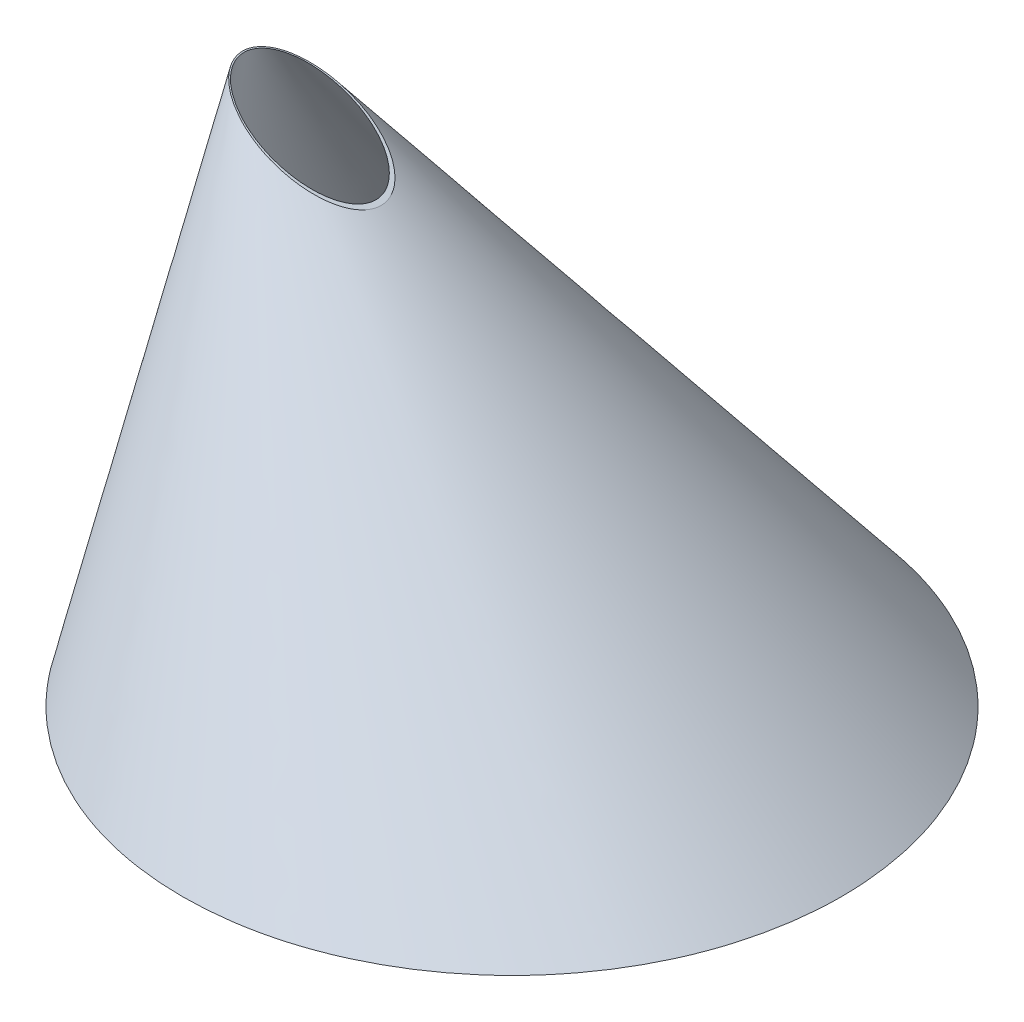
ISO-10303-21;
HEADER;
FILE_DESCRIPTION(('STEP AP214'),'2;1');
FILE_NAME('part.step','',(''),(''),'','','');
FILE_SCHEMA(('AUTOMOTIVE_DESIGN { 1 0 10303 214 1 1 1 1 }'));
ENDSEC;
DATA;
#1=APPLICATION_CONTEXT('core data for automotive mechanical design processes');
#2=APPLICATION_PROTOCOL_DEFINITION('international standard','automotive_design',2000,#1);
#3=PRODUCT_CONTEXT('',#1,'mechanical');
#4=PRODUCT('Part','Part','',(#3));
#5=PRODUCT_RELATED_PRODUCT_CATEGORY('part','',(#4));
#6=PRODUCT_DEFINITION_FORMATION('','',#4);
#7=PRODUCT_DEFINITION_CONTEXT('part definition',#1,'design');
#8=PRODUCT_DEFINITION('design','',#6,#7);
#9=PRODUCT_DEFINITION_SHAPE('','',#8);
#10=(LENGTH_UNIT() NAMED_UNIT(*) SI_UNIT(.MILLI.,.METRE.));
#11=(NAMED_UNIT(*) PLANE_ANGLE_UNIT() SI_UNIT($,.RADIAN.));
#12=(NAMED_UNIT(*) SI_UNIT($,.STERADIAN.) SOLID_ANGLE_UNIT());
#13=UNCERTAINTY_MEASURE_WITH_UNIT(LENGTH_MEASURE(1.E-05),#10,'distance_accuracy_value','');
#14=(GEOMETRIC_REPRESENTATION_CONTEXT(3) GLOBAL_UNCERTAINTY_ASSIGNED_CONTEXT((#13)) GLOBAL_UNIT_ASSIGNED_CONTEXT((#10,
#11,#12)) REPRESENTATION_CONTEXT('',''));
#15=CARTESIAN_POINT('',(0.,0.,0.));
#16=DIRECTION('',(0.,0.,1.));
#17=DIRECTION('',(1.,0.,0.));
#18=AXIS2_PLACEMENT_3D('',#15,#16,#17);
#19=CARTESIAN_POINT('',(-204.380810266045,328.458166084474,1304.35846608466));
#20=DIRECTION('',(0.422618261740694,0.906307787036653,0.));
#21=DIRECTION('',(-0.906307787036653,0.422618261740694,0.));
#22=AXIS2_PLACEMENT_3D('',#19,#20,#21);
#23=PLANE('',#22);
#24=CARTESIAN_POINT('',(-174.818300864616,314.672941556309,31.4771239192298));
#25=CARTESIAN_POINT('',(-175.625932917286,315.04954656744,31.2155909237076));
#26=CARTESIAN_POINT('',(-176.429377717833,315.42419903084,30.9383630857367));
#27=CARTESIAN_POINT('',(-178.026474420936,316.168937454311,30.3513673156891));
#28=CARTESIAN_POINT('',(-178.820126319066,316.539023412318,30.0415993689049));
#29=CARTESIAN_POINT('',(-180.398116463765,317.274852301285,29.3873391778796));
#30=CARTESIAN_POINT('',(-181.182422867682,317.640580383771,29.042753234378));
#31=CARTESIAN_POINT('',(-182.73758616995,318.3657649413,28.3180585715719));
#32=CARTESIAN_POINT('',(-183.508441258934,318.725220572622,27.9379451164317));
#33=CARTESIAN_POINT('',(-185.105457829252,319.469921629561,27.1033807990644));
#34=CARTESIAN_POINT('',(-185.930069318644,319.854444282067,26.6453031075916));
#35=CARTESIAN_POINT('',(-187.556820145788,320.613010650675,25.6822480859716));
#36=CARTESIAN_POINT('',(-188.358953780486,320.987051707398,25.1772589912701));
#37=CARTESIAN_POINT('',(-189.936491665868,321.722669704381,24.1175429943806));
#38=CARTESIAN_POINT('',(-190.711880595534,322.084239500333,23.5627882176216));
#39=CARTESIAN_POINT('',(-192.227177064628,322.790833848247,22.403068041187));
#40=CARTESIAN_POINT('',(-192.967202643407,323.135913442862,21.7982912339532));
#41=CARTESIAN_POINT('',(-194.407643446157,323.807602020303,20.5342898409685));
#42=CARTESIAN_POINT('',(-195.108076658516,324.134219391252,19.8750903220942));
#43=CARTESIAN_POINT('',(-196.460665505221,324.764941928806,18.5000971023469));
#44=CARTESIAN_POINT('',(-197.112873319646,325.06907142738,17.7843663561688));
#45=CARTESIAN_POINT('',(-198.189581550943,325.571148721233,16.4970624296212));
#46=CARTESIAN_POINT('',(-198.627696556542,325.775445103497,15.9393637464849));
#47=CARTESIAN_POINT('',(-199.258360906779,326.069528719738,15.0793362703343));
#48=CARTESIAN_POINT('',(-199.464148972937,326.165489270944,14.7887713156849));
#49=CARTESIAN_POINT('',(-199.866352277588,326.353039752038,14.1997079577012));
#50=CARTESIAN_POINT('',(-200.062764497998,326.44462827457,13.9012070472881));
#51=CARTESIAN_POINT('',(-200.636757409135,326.71228556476,12.9941273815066));
#52=CARTESIAN_POINT('',(-200.999245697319,326.881316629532,12.3737665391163));
#53=CARTESIAN_POINT('',(-201.67806821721,327.197856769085,11.1031580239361));
#54=CARTESIAN_POINT('',(-201.994418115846,327.345373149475,10.4529205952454));
#55=CARTESIAN_POINT('',(-202.480608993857,327.572087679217,9.34074328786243));
#56=CARTESIAN_POINT('',(-202.664643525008,327.657904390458,8.88631731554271));
#57=CARTESIAN_POINT('',(-203.007262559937,327.817670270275,7.96586397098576));
#58=CARTESIAN_POINT('',(-203.165846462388,327.891619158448,7.49983632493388));
#59=CARTESIAN_POINT('',(-203.455747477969,328.02680222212,6.5575356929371));
#60=CARTESIAN_POINT('',(-203.587064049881,328.088036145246,6.08126250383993));
#61=CARTESIAN_POINT('',(-203.820726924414,328.196994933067,5.12075592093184));
#62=CARTESIAN_POINT('',(-203.923109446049,328.244736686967,4.63653328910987));
#63=CARTESIAN_POINT('',(-204.09779484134,328.326193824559,3.66151286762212));
#64=CARTESIAN_POINT('',(-204.170097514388,328.359909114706,3.17071503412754));
#65=CARTESIAN_POINT('',(-204.283617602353,328.412844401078,2.18482286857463));
#66=CARTESIAN_POINT('',(-204.324841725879,328.432067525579,1.68972948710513));
#67=CARTESIAN_POINT('',(-204.366684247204,328.45157901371,0.872850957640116));
#68=CARTESIAN_POINT('',(-204.376501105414,328.456156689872,0.551604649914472));
#69=CARTESIAN_POINT('',(-204.382843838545,328.459114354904,-0.0910759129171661));
#70=CARTESIAN_POINT('',(-204.379369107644,328.457494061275,-0.41251017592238));
#71=CARTESIAN_POINT('',(-204.359159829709,328.448070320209,-1.05482488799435));
#72=CARTESIAN_POINT('',(-204.342427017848,328.440267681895,-1.37570540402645));
#73=CARTESIAN_POINT('',(-204.295789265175,328.418520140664,-2.01629923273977));
#74=CARTESIAN_POINT('',(-204.265884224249,328.404575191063,-2.33601253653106));
#75=CARTESIAN_POINT('',(-204.193085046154,328.37062837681,-2.97369920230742));
#76=CARTESIAN_POINT('',(-204.15018842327,328.35062535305,-3.29167221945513));
#77=CARTESIAN_POINT('',(-204.051653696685,328.30467785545,-3.92517093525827));
#78=CARTESIAN_POINT('',(-203.996015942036,328.278733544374,-4.24069670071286));
#79=CARTESIAN_POINT('',(-203.810440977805,328.192198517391,-5.18278409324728));
#80=CARTESIAN_POINT('',(-203.661826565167,328.122898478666,-5.80499001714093));
#81=CARTESIAN_POINT('',(-203.327843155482,327.967159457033,-6.99786550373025));
#82=CARTESIAN_POINT('',(-203.145087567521,327.881939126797,-7.56943800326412));
#83=CARTESIAN_POINT('',(-202.741186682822,327.693597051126,-8.69602809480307));
#84=CARTESIAN_POINT('',(-202.520027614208,327.590468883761,-9.25103966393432));
#85=CARTESIAN_POINT('',(-202.042578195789,327.36783056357,-10.3422779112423));
#86=CARTESIAN_POINT('',(-201.786288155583,327.248320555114,-10.8785047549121));
#87=CARTESIAN_POINT('',(-201.242013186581,326.994520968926,-11.9307889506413));
#88=CARTESIAN_POINT('',(-200.954032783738,326.860233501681,-12.4468491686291));
#89=CARTESIAN_POINT('',(-200.174352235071,326.496662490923,-13.7510792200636));
#90=CARTESIAN_POINT('',(-199.661254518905,326.257401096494,-14.5237625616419));
#91=CARTESIAN_POINT('',(-198.575297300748,325.751010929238,-16.0162316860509));
#92=CARTESIAN_POINT('',(-198.002409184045,325.483868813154,-16.7359918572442));
#93=CARTESIAN_POINT('',(-196.805437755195,324.925711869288,-18.1248968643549));
#94=CARTESIAN_POINT('',(-196.18122872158,324.634638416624,-18.7939091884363));
#95=CARTESIAN_POINT('',(-194.89131868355,324.033143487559,-20.0809812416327));
#96=CARTESIAN_POINT('',(-194.225619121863,323.722722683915,-20.6990427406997));
#97=CARTESIAN_POINT('',(-192.831957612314,323.072847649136,-21.9105113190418));
#98=CARTESIAN_POINT('',(-192.102566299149,322.732726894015,-22.5019092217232));
#99=CARTESIAN_POINT('',(-190.612298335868,322.037803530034,-23.6349515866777));
#100=CARTESIAN_POINT('',(-189.851406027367,321.682993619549,-24.17657086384));
#101=CARTESIAN_POINT('',(-188.303453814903,320.961171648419,-25.2124893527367));
#102=CARTESIAN_POINT('',(-187.516387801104,320.594156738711,-25.7067774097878));
#103=CARTESIAN_POINT('',(-185.920197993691,319.849841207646,-26.6505342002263));
#104=CARTESIAN_POINT('',(-185.111066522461,319.472537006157,-27.0999870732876));
#105=CARTESIAN_POINT('',(-183.474738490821,318.70950471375,-27.9560088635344));
#106=CARTESIAN_POINT('',(-182.647547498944,318.32377921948,-28.3625907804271));
#107=CARTESIAN_POINT('',(-180.977901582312,317.545210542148,-29.1349796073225));
#108=CARTESIAN_POINT('',(-180.135449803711,317.15236882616,-29.5007948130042));
#109=CARTESIAN_POINT('',(-178.612368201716,316.442144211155,-30.1222041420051));
#110=CARTESIAN_POINT('',(-177.934132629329,316.125877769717,-30.3849845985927));
#111=CARTESIAN_POINT('',(-176.570572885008,315.490039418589,-30.886779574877));
#112=CARTESIAN_POINT('',(-175.885249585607,315.170467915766,-31.1257969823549));
#113=CARTESIAN_POINT('',(-174.509409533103,314.528903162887,-31.5804642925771));
#114=CARTESIAN_POINT('',(-173.818902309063,314.206914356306,-31.796149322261));
#115=CARTESIAN_POINT('',(-172.43248165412,313.560415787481,-32.205194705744));
#116=CARTESIAN_POINT('',(-171.736568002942,313.235905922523,-32.3985541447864));
#117=CARTESIAN_POINT('',(-169.6424016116,312.259380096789,-32.9458250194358));
#118=CARTESIAN_POINT('',(-168.237011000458,311.604035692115,-33.2671627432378));
#119=CARTESIAN_POINT('',(-166.118228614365,310.616031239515,-33.6867184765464));
#120=CARTESIAN_POINT('',(-165.409741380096,310.285658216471,-33.8162229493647));
#121=CARTESIAN_POINT('',(-163.989815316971,309.623535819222,-34.0546974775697));
#122=CARTESIAN_POINT('',(-163.278376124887,309.291786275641,-34.1636649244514));
#123=CARTESIAN_POINT('',(-161.766342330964,308.586713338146,-34.3733429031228));
#124=CARTESIAN_POINT('',(-160.965449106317,308.213250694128,-34.4714286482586));
#125=CARTESIAN_POINT('',(-159.361424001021,307.465281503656,-34.6424485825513));
#126=CARTESIAN_POINT('',(-158.55829201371,307.090774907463,-34.715381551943));
#127=CARTESIAN_POINT('',(-156.950007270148,306.340819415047,-34.8362992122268));
#128=CARTESIAN_POINT('',(-156.144853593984,305.96537008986,-34.8842689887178));
#129=CARTESIAN_POINT('',(-154.533658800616,305.214057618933,-34.9554082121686));
#130=CARTESIAN_POINT('',(-153.727617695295,304.838194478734,-34.9785779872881));
#131=CARTESIAN_POINT('',(-152.114959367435,304.086199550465,-35.0001482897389));
#132=CARTESIAN_POINT('',(-151.308342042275,303.710067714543,-34.9985394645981));
#133=CARTESIAN_POINT('',(-149.695455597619,302.957966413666,-34.970581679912));
#134=CARTESIAN_POINT('',(-148.88918647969,302.581996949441,-34.9442326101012));
#135=CARTESIAN_POINT('',(-147.276539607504,301.830007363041,-34.8665760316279));
#136=CARTESIAN_POINT('',(-146.47016318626,301.45398786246,-34.8152347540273));
#137=CARTESIAN_POINT('',(-144.859044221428,300.70271075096,-34.6875161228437));
#138=CARTESIAN_POINT('',(-144.054301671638,300.32745313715,-34.6111388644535));
#139=CARTESIAN_POINT('',(-142.447399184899,299.578142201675,-34.4330063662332));
#140=CARTESIAN_POINT('',(-141.645238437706,299.204088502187,-34.3312600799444));
#141=CARTESIAN_POINT('',(-140.043956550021,298.457398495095,-34.102137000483));
#142=CARTESIAN_POINT('',(-139.244835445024,298.084762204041,-33.9747599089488));
#143=CARTESIAN_POINT('',(-136.853805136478,296.969806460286,-33.5535806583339));
#144=CARTESIAN_POINT('',(-135.267323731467,296.230018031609,-33.2206313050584));
#145=CARTESIAN_POINT('',(-132.696367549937,295.03116147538,-32.5885346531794));
#146=CARTESIAN_POINT('',(-131.705183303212,294.56896467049,-32.3220305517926));
#147=CARTESIAN_POINT('',(-129.733690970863,293.649642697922,-31.7439701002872));
#148=CARTESIAN_POINT('',(-128.753381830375,293.192517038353,-31.4324181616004));
#149=CARTESIAN_POINT('',(-126.805838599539,292.284362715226,-30.7624067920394));
#150=CARTESIAN_POINT('',(-125.838606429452,291.833334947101,-30.403940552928));
#151=CARTESIAN_POINT('',(-123.921934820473,290.939576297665,-29.6386806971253));
#152=CARTESIAN_POINT('',(-122.972465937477,290.496831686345,-29.2319771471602));
#153=CARTESIAN_POINT('',(-121.092964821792,289.62040592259,-28.3672303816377));
#154=CARTESIAN_POINT('',(-120.16293071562,289.186723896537,-27.9091921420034));
#155=CARTESIAN_POINT('',(-118.32664804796,288.330451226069,-26.9390170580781));
#156=CARTESIAN_POINT('',(-117.420391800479,287.907856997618,-26.426897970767));
#157=CARTESIAN_POINT('',(-115.628046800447,287.072072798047,-25.340140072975));
#158=CARTESIAN_POINT('',(-114.742222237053,286.659006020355,-24.7649666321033));
#159=CARTESIAN_POINT('',(-113.440271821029,286.051896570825,-23.8556177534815));
#160=CARTESIAN_POINT('',(-113.010719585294,285.851593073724,-23.544710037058));
#161=CARTESIAN_POINT('',(-112.161522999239,285.455606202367,-22.9068580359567));
#162=CARTESIAN_POINT('',(-111.741878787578,285.25992289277,-22.5799135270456));
#163=CARTESIAN_POINT('',(-110.50014043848,284.680890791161,-21.5748111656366));
#164=CARTESIAN_POINT('',(-109.694281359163,284.305112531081,-20.8717200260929));
#165=CARTESIAN_POINT('',(-108.526464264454,283.760550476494,-19.7651839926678));
#166=CARTESIAN_POINT('',(-108.144064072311,283.582234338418,-19.3877373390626));
#167=CARTESIAN_POINT('',(-107.394246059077,283.232588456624,-18.6149107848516));
#168=CARTESIAN_POINT('',(-107.026831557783,283.061260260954,-18.21952695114));
#169=CARTESIAN_POINT('',(-106.162288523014,282.658117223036,-17.245421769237));
#170=CARTESIAN_POINT('',(-105.673404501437,282.430146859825,-16.6577212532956));
#171=CARTESIAN_POINT('',(-104.73466166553,281.992403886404,-15.4456993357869));
#172=CARTESIAN_POINT('',(-104.284791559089,281.782626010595,-14.821388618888));
#173=CARTESIAN_POINT('',(-103.430567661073,281.384294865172,-13.5367516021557));
#174=CARTESIAN_POINT('',(-103.026168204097,281.19572030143,-12.8764624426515));
#175=CARTESIAN_POINT('',(-102.269482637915,280.842872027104,-11.5204195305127));
#176=CARTESIAN_POINT('',(-101.917185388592,280.678593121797,-10.8246734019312));
#177=CARTESIAN_POINT('',(-101.33479841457,280.407021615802,-9.53883258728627));
#178=CARTESIAN_POINT('',(-101.094265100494,280.294859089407,-8.95448978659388));
#179=CARTESIAN_POINT('',(-100.655768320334,280.090384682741,-7.76663768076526));
#180=CARTESIAN_POINT('',(-100.45780023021,279.998070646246,-7.16313046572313));
#181=CARTESIAN_POINT('',(-100.108128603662,279.835016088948,-5.94034398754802));
#182=CARTESIAN_POINT('',(-99.9563969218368,279.764262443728,-5.32107456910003));
#183=CARTESIAN_POINT('',(-99.7022687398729,279.645760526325,-4.07029169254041));
#184=CARTESIAN_POINT('',(-99.5998725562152,279.59801240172,-3.43877815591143));
#185=CARTESIAN_POINT('',(-99.4462958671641,279.526398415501,-2.16501235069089));
#186=CARTESIAN_POINT('',(-99.3953618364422,279.502647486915,-1.52272324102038));
#187=CARTESIAN_POINT('',(-99.3589281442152,279.485658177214,-0.557634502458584));
#188=CARTESIAN_POINT('',(-99.3534467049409,279.483102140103,-0.235620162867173));
#189=CARTESIAN_POINT('',(-99.3558333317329,279.484215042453,0.408348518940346));
#190=CARTESIAN_POINT('',(-99.3637013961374,279.48788398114,0.730302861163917));
#191=CARTESIAN_POINT('',(-99.4072701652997,279.508200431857,1.69509733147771));
#192=CARTESIAN_POINT('',(-99.4629316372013,279.534155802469,2.33697056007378));
#193=CARTESIAN_POINT('',(-99.6261855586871,279.610282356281,3.61248707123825));
#194=CARTESIAN_POINT('',(-99.7337771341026,279.66045313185,4.24613049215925));
#195=CARTESIAN_POINT('',(-99.9893280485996,279.779618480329,5.45720028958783));
#196=CARTESIAN_POINT('',(-100.133978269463,279.847069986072,6.0354823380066));
#197=CARTESIAN_POINT('',(-100.463495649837,280.000726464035,7.17782307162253));
#198=CARTESIAN_POINT('',(-100.64835964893,280.086929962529,7.74188287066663));
#199=CARTESIAN_POINT('',(-101.055405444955,280.276738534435,8.85340517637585));
#200=CARTESIAN_POINT('',(-101.277593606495,280.380346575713,9.40086483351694));
#201=CARTESIAN_POINT('',(-101.75609272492,280.603474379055,10.4774307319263));
#202=CARTESIAN_POINT('',(-102.01241161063,280.722997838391,11.0065326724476));
#203=CARTESIAN_POINT('',(-102.486231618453,280.943943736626,11.9118634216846));
#204=CARTESIAN_POINT('',(-102.696842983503,281.042153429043,12.2925154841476));
#205=CARTESIAN_POINT('',(-103.133890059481,281.245951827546,13.0426146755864));
#206=CARTESIAN_POINT('',(-103.36032729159,281.35154124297,13.412060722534));
#207=CARTESIAN_POINT('',(-104.061605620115,281.678552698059,14.5034611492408));
#208=CARTESIAN_POINT('',(-104.55837637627,281.910200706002,15.208407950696));
#209=CARTESIAN_POINT('',(-105.602182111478,282.396935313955,16.5734110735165));
#210=CARTESIAN_POINT('',(-106.149316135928,282.652068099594,17.2333742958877));
#211=CARTESIAN_POINT('',(-107.285266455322,283.181770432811,18.5079083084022));
#212=CARTESIAN_POINT('',(-107.874083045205,283.456340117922,19.1224787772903));
#213=CARTESIAN_POINT('',(-109.100553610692,284.02825273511,20.3212515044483));
#214=CARTESIAN_POINT('',(-109.739013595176,284.325971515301,20.9044455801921));
#215=CARTESIAN_POINT('',(-111.047144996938,284.935963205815,22.0270725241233));
#216=CARTESIAN_POINT('',(-111.716830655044,285.248242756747,22.5664851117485));
#217=CARTESIAN_POINT('',(-113.082406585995,285.885021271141,23.6033880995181));
#218=CARTESIAN_POINT('',(-113.778300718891,286.209522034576,24.1008722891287));
#219=CARTESIAN_POINT('',(-115.19322293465,286.869311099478,25.056627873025));
#220=CARTESIAN_POINT('',(-115.912283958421,287.204614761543,25.5148397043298));
#221=CARTESIAN_POINT('',(-117.369088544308,287.883933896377,26.3930410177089));
#222=CARTESIAN_POINT('',(-118.106828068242,288.227947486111,26.8130386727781));
#223=CARTESIAN_POINT('',(-119.598389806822,288.923474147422,27.6166857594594));
#224=CARTESIAN_POINT('',(-120.352213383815,289.274987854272,28.0003320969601));
#225=CARTESIAN_POINT('',(-122.31756733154,290.191447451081,28.9466990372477));
#226=CARTESIAN_POINT('',(-123.539520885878,290.761253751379,29.4832931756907));
#227=CARTESIAN_POINT('',(-125.392577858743,291.625348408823,30.2270439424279));
#228=CARTESIAN_POINT('',(-126.013805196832,291.915031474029,30.4648322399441));
#229=CARTESIAN_POINT('',(-127.262196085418,292.497165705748,30.9206039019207));
#230=CARTESIAN_POINT('',(-127.889359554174,292.789616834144,31.1385875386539));
#231=CARTESIAN_POINT('',(-129.778944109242,293.670744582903,31.7636977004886));
#232=CARTESIAN_POINT('',(-131.049330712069,294.263135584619,32.1419321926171));
#233=CARTESIAN_POINT('',(-132.967753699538,295.157710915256,32.6544403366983));
#234=CARTESIAN_POINT('',(-133.609908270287,295.457152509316,32.8162475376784));
#235=CARTESIAN_POINT('',(-134.897740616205,296.057678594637,33.1218379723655));
#236=CARTESIAN_POINT('',(-135.543418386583,296.358763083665,33.2656212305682));
#237=CARTESIAN_POINT('',(-137.484629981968,297.263964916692,33.6703014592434));
#238=CARTESIAN_POINT('',(-138.784772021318,297.87023110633,33.9046431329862));
#239=CARTESIAN_POINT('',(-141.393581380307,299.086738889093,34.3047947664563));
#240=CARTESIAN_POINT('',(-142.702248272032,299.696980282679,34.4706081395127));
#241=CARTESIAN_POINT('',(-144.699883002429,300.628492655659,34.6719568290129));
#242=CARTESIAN_POINT('',(-145.386897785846,300.948852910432,34.7319167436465));
#243=CARTESIAN_POINT('',(-146.762047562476,301.590095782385,34.8336392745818));
#244=CARTESIAN_POINT('',(-147.450182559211,301.910978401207,34.8754018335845));
#245=CARTESIAN_POINT('',(-148.827200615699,302.553092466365,34.9407453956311));
#246=CARTESIAN_POINT('',(-149.516083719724,302.874323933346,34.9643252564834));
#247=CARTESIAN_POINT('',(-150.894188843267,303.516944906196,34.9933986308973));
#248=CARTESIAN_POINT('',(-151.583410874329,303.83833441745,34.9988914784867));
#249=CARTESIAN_POINT('',(-152.961921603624,304.481144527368,34.9918181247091));
#250=CARTESIAN_POINT('',(-153.651210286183,304.802565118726,34.9792481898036));
#251=CARTESIAN_POINT('',(-155.029294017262,305.445176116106,34.9359494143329));
#252=CARTESIAN_POINT('',(-155.718089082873,305.7663665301,34.9052212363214));
#253=CARTESIAN_POINT('',(-157.093102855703,306.407545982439,34.8257221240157));
#254=CARTESIAN_POINT('',(-157.779323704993,306.727536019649,34.7769963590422));
#255=CARTESIAN_POINT('',(-159.150497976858,307.366925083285,34.6612800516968));
#256=CARTESIAN_POINT('',(-159.835451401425,307.68632411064,34.594289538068));
#257=CARTESIAN_POINT('',(-161.20354374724,308.324276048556,34.4419881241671));
#258=CARTESIAN_POINT('',(-161.886683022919,308.642829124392,34.3566811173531));
#259=CARTESIAN_POINT('',(-163.250845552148,309.27894855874,34.1674562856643));
#260=CARTESIAN_POINT('',(-163.931868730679,309.59651488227,34.0635378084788));
#261=CARTESIAN_POINT('',(-165.970362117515,310.547079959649,33.7236813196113));
#262=CARTESIAN_POINT('',(-167.324099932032,311.178338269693,33.4595489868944));
#263=CARTESIAN_POINT('',(-169.7055165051,312.288811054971,32.9235553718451));
#264=CARTESIAN_POINT('',(-170.73617276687,312.76941396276,32.667619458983));
#265=CARTESIAN_POINT('',(-172.786176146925,313.725346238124,32.1083679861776));
#266=CARTESIAN_POINT('',(-173.805530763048,314.200679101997,31.8050861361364));
#267=CARTESIAN_POINT('',(-174.818300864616,314.672941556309,31.4771239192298));
#268=B_SPLINE_CURVE_WITH_KNOTS('',3,(#24,#25,#26,#27,#28,#29,#30,#31,#32,#33,#34,#35,#36,#37,
#38,#39,#40,#41,#42,#43,#44,#45,#46,#47,#48,#49,#50,#51,#52,#53,#54,#55,#56,#57,#58,#59,#60,#61,
#62,#63,#64,#65,#66,#67,#68,#69,#70,#71,#72,#73,#74,#75,#76,#77,#78,#79,#80,#81,#82,#83,#84,#85,
#86,#87,#88,#89,#90,#91,#92,#93,#94,#95,#96,#97,#98,#99,#100,#101,#102,#103,#104,#105,#106,#107,
#108,#109,#110,#111,#112,#113,#114,#115,#116,#117,#118,#119,#120,#121,#122,#123,#124,#125,#126,
#127,#128,#129,#130,#131,#132,#133,#134,#135,#136,#137,#138,#139,#140,#141,#142,#143,#144,#145,
#146,#147,#148,#149,#150,#151,#152,#153,#154,#155,#156,#157,#158,#159,#160,#161,#162,#163,#164,
#165,#166,#167,#168,#169,#170,#171,#172,#173,#174,#175,#176,#177,#178,#179,#180,#181,#182,#183,
#184,#185,#186,#187,#188,#189,#190,#191,#192,#193,#194,#195,#196,#197,#198,#199,#200,#201,#202,
#203,#204,#205,#206,#207,#208,#209,#210,#211,#212,#213,#214,#215,#216,#217,#218,#219,#220,#221,
#222,#223,#224,#225,#226,#227,#228,#229,#230,#231,#232,#233,#234,#235,#236,#237,#238,#239,#240,
#241,#242,#243,#244,#245,#246,#247,#248,#249,#250,#251,#252,#253,#254,#255,#256,#257,#258,#259,
#260,#261,#262,#263,#264,#265,#266,#267),.UNSPECIFIED.,.T.,.F.,(4,2,2,2,2,2,2,2,2,2,2,2,2,2,2,2,
2,2,2,2,2,2,2,2,2,2,2,2,2,2,2,2,2,2,2,2,2,2,2,2,2,2,2,2,2,2,2,2,2,2,2,2,2,2,2,2,2,2,2,2,2,2,2,2,
2,2,2,2,2,2,2,2,2,2,2,2,2,2,2,2,2,2,2,2,2,2,2,2,2,2,2,2,2,2,2,2,2,2,2,2,2,2,2,2,2,2,2,2,2,2,2,2,
2,2,2,2,2,2,2,2,2,4),(0.,2.78594399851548,5.57188925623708,8.36554227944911,11.1595682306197,
14.214272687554,17.2697452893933,20.3269401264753,23.3730927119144,26.4178499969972,
29.4592631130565,31.6717680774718,32.7778441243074,33.8842738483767,36.096341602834,
38.307656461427,39.8000177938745,41.2924143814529,42.7848405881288,44.2753902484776,
45.765949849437,47.2561876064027,48.2201723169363,49.1842009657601,50.1481034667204,
51.1120132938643,52.0761076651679,53.0401756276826,54.9679070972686,56.7844839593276,
58.6017136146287,60.4189272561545,62.2358817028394,65.1050392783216,67.9755763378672,
70.8533678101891,73.7310592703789,76.7251776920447,79.7208027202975,82.7171320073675,
85.7145175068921,88.7109914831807,91.706854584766,94.085904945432,96.4646658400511,
98.8397941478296,101.215019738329,105.963014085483,108.339967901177,110.71722342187,
113.384201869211,116.051309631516,118.720009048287,121.388673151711,124.058344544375,
126.728027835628,129.401328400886,132.074618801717,134.746967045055,137.419346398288,
142.761098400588,146.137262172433,149.513095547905,152.889419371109,156.259535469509,
159.629325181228,162.998011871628,166.397867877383,168.098066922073,169.798289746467,
173.194994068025,174.892937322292,176.591254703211,178.98255096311,181.373152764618,
183.761331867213,186.148999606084,188.072543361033,189.995878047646,191.918039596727,
193.840213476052,195.771550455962,196.737471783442,197.703392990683,199.6349313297,
201.566437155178,203.364266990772,205.16195558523,206.959951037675,208.758364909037,
210.095821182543,211.433406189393,214.108818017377,216.7896086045,219.470418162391,
222.212180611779,224.955205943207,227.698636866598,230.446157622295,233.193089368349,
235.940254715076,240.29034365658,242.466679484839,244.642985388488,248.996049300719,
251.176212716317,253.356373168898,257.715231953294,262.073873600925,264.354901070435,
266.635935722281,268.91711365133,271.198375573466,273.48010909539,275.761759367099,
278.037721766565,280.313680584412,282.589156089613,284.864711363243,289.413017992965,
292.909067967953,296.402640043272),.UNSPECIFIED.);
#269=CARTESIAN_POINT('',(-174.818300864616,314.672941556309,31.4771239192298));
#270=VERTEX_POINT('',#269);
#271=EDGE_CURVE('E44',#270,#270,#268,.T.);
#272=ORIENTED_EDGE('',*,*,#271,.F.);
#273=EDGE_LOOP('',(#272));
#274=FACE_BOUND('',#273,.T.);
#275=CARTESIAN_POINT('',(-134.129526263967,295.699454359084,-30.9110388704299));
#276=CARTESIAN_POINT('',(-132.791987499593,295.075749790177,-30.5404226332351));
#277=CARTESIAN_POINT('',(-131.463876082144,294.456441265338,-30.1271774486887));
#278=CARTESIAN_POINT('',(-129.491211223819,293.536572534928,-29.4399423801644));
#279=CARTESIAN_POINT('',(-128.836867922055,293.231447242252,-29.1996196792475));
#280=CARTESIAN_POINT('',(-127.535528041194,292.624622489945,-28.6957501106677));
#281=CARTESIAN_POINT('',(-126.888531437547,292.322923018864,-28.4322033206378));
#282=CARTESIAN_POINT('',(-125.603533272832,291.723718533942,-27.8813167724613));
#283=CARTESIAN_POINT('',(-124.965524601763,291.426210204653,-27.5939972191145));
#284=CARTESIAN_POINT('',(-123.699153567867,290.835691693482,-26.9944697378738));
#285=CARTESIAN_POINT('',(-123.070791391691,290.542681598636,-26.6822613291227));
#286=CARTESIAN_POINT('',(-121.825289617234,289.961894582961,-26.0320581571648));
#287=CARTESIAN_POINT('',(-121.208147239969,289.67411636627,-25.6940698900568));
#288=CARTESIAN_POINT('',(-119.986628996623,289.104513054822,-24.9911905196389));
#289=CARTESIAN_POINT('',(-119.382252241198,288.822687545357,-24.6263012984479));
#290=CARTESIAN_POINT('',(-117.945339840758,288.152644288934,-23.7144237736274));
#291=CARTESIAN_POINT('',(-117.119907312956,287.767738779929,-23.1536990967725));
#292=CARTESIAN_POINT('',(-115.504200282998,287.014322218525,-21.97315669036));
#293=CARTESIAN_POINT('',(-114.713927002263,286.645811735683,-21.353336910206));
#294=CARTESIAN_POINT('',(-113.561694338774,286.108516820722,-20.377094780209));
#295=CARTESIAN_POINT('',(-113.183332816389,285.932083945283,-20.0441122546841));
#296=CARTESIAN_POINT('',(-112.438665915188,285.584840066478,-19.3621354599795));
#297=CARTESIAN_POINT('',(-112.072360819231,285.414029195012,-19.0131408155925));
#298=CARTESIAN_POINT('',(-110.993716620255,284.911049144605,-17.9417349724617));
#299=CARTESIAN_POINT('',(-110.301189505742,284.588118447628,-17.1945164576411));
#300=CARTESIAN_POINT('',(-109.18364165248,284.066997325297,-15.8701931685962));
#301=CARTESIAN_POINT('',(-108.741425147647,283.860788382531,-15.3106608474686));
#302=CARTESIAN_POINT('',(-107.894088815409,283.465668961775,-14.1582203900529));
#303=CARTESIAN_POINT('',(-107.488966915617,283.276757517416,-13.56531412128));
#304=CARTESIAN_POINT('',(-106.722039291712,282.919133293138,-12.3471539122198));
#305=CARTESIAN_POINT('',(-106.360187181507,282.75039888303,-11.7219356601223));
#306=CARTESIAN_POINT('',(-105.685654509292,282.435859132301,-10.4399345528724));
#307=CARTESIAN_POINT('',(-105.372964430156,282.290049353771,-9.78315783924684));
#308=CARTESIAN_POINT('',(-104.854879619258,282.048462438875,-8.56216095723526));
#309=CARTESIAN_POINT('',(-104.640307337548,281.948405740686,-8.00267659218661));
#310=CARTESIAN_POINT('',(-104.252177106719,281.767417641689,-6.866617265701));
#311=CARTESIAN_POINT('',(-104.078614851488,281.686484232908,-6.29004410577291));
#312=CARTESIAN_POINT('',(-103.77582207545,281.545289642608,-5.12320075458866));
#313=CARTESIAN_POINT('',(-103.64656571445,281.485016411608,-4.53293876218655));
#314=CARTESIAN_POINT('',(-103.435020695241,281.386371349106,-3.3422015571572));
#315=CARTESIAN_POINT('',(-103.352732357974,281.347999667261,-2.74172627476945));
#316=CARTESIAN_POINT('',(-103.236646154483,281.293867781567,-1.53263803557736));
#317=CARTESIAN_POINT('',(-103.203043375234,281.278198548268,-0.924002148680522));
#318=CARTESIAN_POINT('',(-103.185848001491,281.270180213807,0.294135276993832));
#319=CARTESIAN_POINT('',(-103.202255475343,281.277831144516,0.903636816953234));
#320=CARTESIAN_POINT('',(-103.284613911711,281.316235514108,2.11863485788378));
#321=CARTESIAN_POINT('',(-103.350573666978,281.346993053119,2.72413062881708));
#322=CARTESIAN_POINT('',(-103.530571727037,281.430927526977,3.92632022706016));
#323=CARTESIAN_POINT('',(-103.644609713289,281.484104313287,4.52301411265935));
#324=CARTESIAN_POINT('',(-103.910543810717,281.608111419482,5.67008935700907));
#325=CARTESIAN_POINT('',(-104.05993679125,281.677774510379,6.22118253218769));
#326=CARTESIAN_POINT('',(-104.396621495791,281.83477316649,7.30899685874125));
#327=CARTESIAN_POINT('',(-104.583910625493,281.92210752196,7.84571899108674));
#328=CARTESIAN_POINT('',(-104.993529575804,282.113115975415,8.90267713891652));
#329=CARTESIAN_POINT('',(-105.215865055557,282.216792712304,9.42291047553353));
#330=CARTESIAN_POINT('',(-105.692430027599,282.439018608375,10.4453251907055));
#331=CARTESIAN_POINT('',(-105.946666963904,282.55757123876,10.9475023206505));
#332=CARTESIAN_POINT('',(-106.62243445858,282.87268679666,12.1864444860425));
#333=CARTESIAN_POINT('',(-107.062693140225,283.07798279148,12.9108380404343));
#334=CARTESIAN_POINT('',(-107.999408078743,283.514780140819,14.3139662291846));
#335=CARTESIAN_POINT('',(-108.495888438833,283.746292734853,14.9926810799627));
#336=CARTESIAN_POINT('',(-109.537246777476,284.231886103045,16.3055705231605));
#337=CARTESIAN_POINT('',(-110.08222300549,284.486012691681,16.9396498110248));
#338=CARTESIAN_POINT('',(-111.211957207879,285.012816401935,18.1628336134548));
#339=CARTESIAN_POINT('',(-111.796715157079,285.285493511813,18.7519381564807));
#340=CARTESIAN_POINT('',(-113.016490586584,285.854284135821,19.9027661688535));
#341=CARTESIAN_POINT('',(-113.652457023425,286.150840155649,20.4632606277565));
#342=CARTESIAN_POINT('',(-114.954355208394,286.757925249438,21.5406852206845));
#343=CARTESIAN_POINT('',(-115.620300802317,287.068460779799,22.0575949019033));
#344=CARTESIAN_POINT('',(-116.977226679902,287.701205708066,23.0498321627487));
#345=CARTESIAN_POINT('',(-117.668210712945,288.023416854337,23.5251534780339));
#346=CARTESIAN_POINT('',(-119.07229569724,288.678152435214,24.4369190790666));
#347=CARTESIAN_POINT('',(-119.785428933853,289.010691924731,24.8733026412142));
#348=CARTESIAN_POINT('',(-121.229441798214,289.684046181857,25.708188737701));
#349=CARTESIAN_POINT('',(-121.960317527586,290.024859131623,26.1066995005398));
#350=CARTESIAN_POINT('',(-123.43730750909,290.713590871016,26.867742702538));
#351=CARTESIAN_POINT('',(-124.183423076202,291.06151027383,27.2302720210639));
#352=CARTESIAN_POINT('',(-126.121527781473,291.965263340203,28.1195954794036));
#353=CARTESIAN_POINT('',(-127.323156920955,292.525592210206,28.6209482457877));
#354=CARTESIAN_POINT('',(-129.751735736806,293.658057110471,29.5439001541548));
#355=CARTESIAN_POINT('',(-130.97869714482,294.230198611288,29.9654613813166));
#356=CARTESIAN_POINT('',(-133.45208390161,295.383557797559,30.7329010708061));
#357=CARTESIAN_POINT('',(-134.698512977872,295.964777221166,31.0787648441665));
#358=CARTESIAN_POINT('',(-137.207514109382,297.134743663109,31.6986513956));
#359=CARTESIAN_POINT('',(-138.470103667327,297.723498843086,31.9725878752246));
#360=CARTESIAN_POINT('',(-140.371805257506,298.610276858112,32.3309844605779));
#361=CARTESIAN_POINT('',(-141.006953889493,298.906451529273,32.4416913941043));
#362=CARTESIAN_POINT('',(-142.279526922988,299.499862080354,32.6459408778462));
#363=CARTESIAN_POINT('',(-142.916951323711,299.797097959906,32.739483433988));
#364=CARTESIAN_POINT('',(-144.193635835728,300.392425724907,32.9095821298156));
#365=CARTESIAN_POINT('',(-144.832895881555,300.690517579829,32.9861388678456));
#366=CARTESIAN_POINT('',(-146.112869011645,301.287378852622,33.1224160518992));
#367=CARTESIAN_POINT('',(-146.753582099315,301.586148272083,33.1821364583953));
#368=CARTESIAN_POINT('',(-148.732356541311,302.508865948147,33.3407529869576));
#369=CARTESIAN_POINT('',(-150.072376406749,303.133727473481,33.4117981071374));
#370=CARTESIAN_POINT('',(-152.083410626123,304.071488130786,33.4644276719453));
#371=CARTESIAN_POINT('',(-152.753969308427,304.384174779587,33.4729798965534));
#372=CARTESIAN_POINT('',(-154.095099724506,305.009554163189,33.4721859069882));
#373=CARTESIAN_POINT('',(-154.76567145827,305.322246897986,33.4628397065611));
#374=CARTESIAN_POINT('',(-156.106504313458,305.947487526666,33.4261225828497));
#375=CARTESIAN_POINT('',(-156.77676537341,306.260035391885,33.3987489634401));
#376=CARTESIAN_POINT('',(-158.116487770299,306.884758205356,33.3260080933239));
#377=CARTESIAN_POINT('',(-158.785949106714,307.196933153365,33.2806408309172));
#378=CARTESIAN_POINT('',(-160.12303184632,307.82042507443,33.1717424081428));
#379=CARTESIAN_POINT('',(-160.790654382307,308.131742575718,33.1082282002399));
#380=CARTESIAN_POINT('',(-162.124265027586,308.753615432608,32.9629487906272));
#381=CARTESIAN_POINT('',(-162.790253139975,309.064170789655,32.8811836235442));
#382=CARTESIAN_POINT('',(-164.120056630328,309.684268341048,32.6991240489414));
#383=CARTESIAN_POINT('',(-164.783872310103,309.993810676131,32.5988323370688));
#384=CARTESIAN_POINT('',(-166.108959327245,310.611708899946,32.3795025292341));
#385=CARTESIAN_POINT('',(-166.770230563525,310.92006474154,32.2604636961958));
#386=CARTESIAN_POINT('',(-168.749128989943,311.84284023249,31.874797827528));
#387=CARTESIAN_POINT('',(-170.062320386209,312.455191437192,31.5795563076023));
#388=CARTESIAN_POINT('',(-172.303715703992,313.500371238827,31.0042052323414));
#389=CARTESIAN_POINT('',(-173.236021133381,313.935112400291,30.7433220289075));
#390=CARTESIAN_POINT('',(-175.090017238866,314.799644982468,30.1791294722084));
#391=CARTESIAN_POINT('',(-176.011708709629,315.229436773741,29.8758233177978));
#392=CARTESIAN_POINT('',(-177.842345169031,316.083076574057,29.2249729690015));
#393=CARTESIAN_POINT('',(-178.751288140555,316.506923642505,28.8774218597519));
#394=CARTESIAN_POINT('',(-180.55271684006,317.346943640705,28.1363946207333));
#395=CARTESIAN_POINT('',(-181.445218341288,317.763123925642,27.7429654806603));
#396=CARTESIAN_POINT('',(-182.769705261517,318.380742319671,27.11639080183));
#397=CARTESIAN_POINT('',(-183.208818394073,318.585504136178,26.9014634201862));
#398=CARTESIAN_POINT('',(-184.081852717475,318.992606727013,26.4591384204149));
#399=CARTESIAN_POINT('',(-184.515773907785,319.19494750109,26.2317408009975));
#400=CARTESIAN_POINT('',(-185.808675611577,319.79783746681,25.5304358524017));
#401=CARTESIAN_POINT('',(-186.65916887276,320.194428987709,25.0372402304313));
#402=CARTESIAN_POINT('',(-188.335225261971,320.975986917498,23.9947479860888));
#403=CARTESIAN_POINT('',(-189.160695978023,321.360910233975,23.4452700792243));
#404=CARTESIAN_POINT('',(-190.777642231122,322.114904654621,22.2881271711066));
#405=CARTESIAN_POINT('',(-191.569117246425,322.483975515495,21.6804612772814));
#406=CARTESIAN_POINT('',(-193.109432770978,323.202236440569,20.404163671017));
#407=CARTESIAN_POINT('',(-193.8583193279,323.551447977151,19.7355999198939));
#408=CARTESIAN_POINT('',(-195.304556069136,324.225839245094,18.3336903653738));
#409=CARTESIAN_POINT('',(-196.001924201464,324.551027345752,17.6003673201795));
#410=CARTESIAN_POINT('',(-197.142502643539,325.082887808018,16.2859929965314));
#411=CARTESIAN_POINT('',(-197.601341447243,325.296847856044,15.721409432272));
#412=CARTESIAN_POINT('',(-198.481419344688,325.707234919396,14.5573532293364));
#413=CARTESIAN_POINT('',(-198.902660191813,325.903662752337,13.9578822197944));
#414=CARTESIAN_POINT('',(-199.501497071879,326.182904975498,13.0332586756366));
#415=CARTESIAN_POINT('',(-199.695529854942,326.273383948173,12.7209527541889));
#416=CARTESIAN_POINT('',(-200.071891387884,326.448884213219,12.0878704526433));
#417=CARTESIAN_POINT('',(-200.254220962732,326.533905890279,11.7670946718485));
#418=CARTESIAN_POINT('',(-200.606302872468,326.698084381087,11.1173505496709));
#419=CARTESIAN_POINT('',(-200.776058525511,326.777242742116,10.7883844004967));
#420=CARTESIAN_POINT('',(-201.102234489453,326.929341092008,10.1224012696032));
#421=CARTESIAN_POINT('',(-201.258651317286,327.002279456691,9.78538221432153));
#422=CARTESIAN_POINT('',(-201.650072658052,327.184802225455,8.89168545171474));
#423=CARTESIAN_POINT('',(-201.873465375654,327.288971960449,8.3287297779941));
#424=CARTESIAN_POINT('',(-202.279066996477,327.478107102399,7.18517645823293));
#425=CARTESIAN_POINT('',(-202.461284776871,327.563076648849,6.60458264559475));
#426=CARTESIAN_POINT('',(-202.781094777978,327.71220650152,5.42878186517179));
#427=CARTESIAN_POINT('',(-202.918710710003,327.776377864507,4.83358284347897));
#428=CARTESIAN_POINT('',(-203.089653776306,327.856089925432,3.93274454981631));
#429=CARTESIAN_POINT('',(-203.140725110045,327.879904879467,3.63109045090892));
#430=CARTESIAN_POINT('',(-203.23077775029,327.92189711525,3.025555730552));
#431=CARTESIAN_POINT('',(-203.269758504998,327.940074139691,2.72167500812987));
#432=CARTESIAN_POINT('',(-203.335551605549,327.970753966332,2.11101626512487));
#433=CARTESIAN_POINT('',(-203.362311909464,327.983232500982,1.80423142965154));
#434=CARTESIAN_POINT('',(-203.403257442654,328.002325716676,1.18961065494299));
#435=CARTESIAN_POINT('',(-203.417441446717,328.008939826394,0.881774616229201));
#436=CARTESIAN_POINT('',(-203.433155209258,328.016267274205,0.265733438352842));
#437=CARTESIAN_POINT('',(-203.434686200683,328.016981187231,-0.04247166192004));
#438=CARTESIAN_POINT('',(-203.425086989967,328.012505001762,-0.658650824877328));
#439=CARTESIAN_POINT('',(-203.413955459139,328.00731428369,-0.966624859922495));
#440=CARTESIAN_POINT('',(-203.361636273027,327.982917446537,-1.88926349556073));
#441=CARTESIAN_POINT('',(-203.301526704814,327.954887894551,-2.50275091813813));
#442=CARTESIAN_POINT('',(-203.132202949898,327.875930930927,-3.72128051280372));
#443=CARTESIAN_POINT('',(-203.022989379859,327.825003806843,-4.32632279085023));
#444=CARTESIAN_POINT('',(-202.766000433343,327.705167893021,-5.48703484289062));
#445=CARTESIAN_POINT('',(-202.621000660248,327.637553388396,-6.04345693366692));
#446=CARTESIAN_POINT('',(-202.292403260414,327.484325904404,-7.14214821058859));
#447=CARTESIAN_POINT('',(-202.108808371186,327.398714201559,-7.68441839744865));
#448=CARTESIAN_POINT('',(-201.705947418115,327.21085705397,-8.75265593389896));
#449=CARTESIAN_POINT('',(-201.486674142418,327.108608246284,-9.27861996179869));
#450=CARTESIAN_POINT('',(-201.015491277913,326.888892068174,-10.3124347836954));
#451=CARTESIAN_POINT('',(-200.763576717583,326.771422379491,-10.8202828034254));
#452=CARTESIAN_POINT('',(-200.098848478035,326.461454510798,-12.0621285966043));
#453=CARTESIAN_POINT('',(-199.667884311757,326.260492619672,-12.7843583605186));
#454=CARTESIAN_POINT('',(-198.749834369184,325.832398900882,-14.1840161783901));
#455=CARTESIAN_POINT('',(-198.262725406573,325.60525626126,-14.8614255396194));
#456=CARTESIAN_POINT('',(-197.240138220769,325.128416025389,-16.1724115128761));
#457=CARTESIAN_POINT('',(-196.704564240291,324.878673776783,-16.8058967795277));
#458=CARTESIAN_POINT('',(-195.593427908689,324.360542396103,-18.028393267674));
#459=CARTESIAN_POINT('',(-195.01786540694,324.092153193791,-18.6174043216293));
#460=CARTESIAN_POINT('',(-193.820710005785,323.53391046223,-19.7643355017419));
#461=CARTESIAN_POINT('',(-193.198406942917,323.243725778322,-20.3213497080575));
#462=CARTESIAN_POINT('',(-191.924040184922,322.649478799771,-21.3927848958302));
#463=CARTESIAN_POINT('',(-191.271962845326,322.345410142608,-21.9071860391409));
#464=CARTESIAN_POINT('',(-189.942852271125,321.725635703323,-22.8952085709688));
#465=CARTESIAN_POINT('',(-189.26581542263,321.409928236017,-23.3688240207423));
#466=CARTESIAN_POINT('',(-187.889706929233,320.768238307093,-24.2778458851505));
#467=CARTESIAN_POINT('',(-187.190604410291,320.442241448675,-24.7131952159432));
#468=CARTESIAN_POINT('',(-185.774656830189,319.781974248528,-25.546707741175));
#469=CARTESIAN_POINT('',(-185.057815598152,319.447705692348,-25.9448788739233));
#470=CARTESIAN_POINT('',(-183.608879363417,318.772055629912,-26.705891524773));
#471=CARTESIAN_POINT('',(-182.876783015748,318.430673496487,-27.0687299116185));
#472=CARTESIAN_POINT('',(-180.972179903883,317.542542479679,-27.9608630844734));
#473=CARTESIAN_POINT('',(-179.789941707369,316.991255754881,-28.4649990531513));
#474=CARTESIAN_POINT('',(-177.399932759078,315.876776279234,-29.3946460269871));
#475=CARTESIAN_POINT('',(-176.192150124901,315.31357798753,-29.8201195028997));
#476=CARTESIAN_POINT('',(-173.756912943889,314.178008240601,-30.5966466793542));
#477=CARTESIAN_POINT('',(-172.529454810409,313.605635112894,-30.9476866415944));
#478=CARTESIAN_POINT('',(-170.057690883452,312.453032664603,-31.5792264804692));
#479=CARTESIAN_POINT('',(-168.813360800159,311.872792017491,-31.8596099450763));
#480=CARTESIAN_POINT('',(-166.313902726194,310.707275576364,-32.3517906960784));
#481=CARTESIAN_POINT('',(-165.058777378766,310.122001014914,-32.5636043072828));
#482=CARTESIAN_POINT('',(-163.170400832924,309.241436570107,-32.8313683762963));
#483=CARTESIAN_POINT('',(-162.539970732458,308.947462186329,-32.912299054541));
#484=CARTESIAN_POINT('',(-161.27753939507,308.358780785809,-33.0577366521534));
#485=CARTESIAN_POINT('',(-160.645538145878,308.064073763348,-33.1222434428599));
#486=CARTESIAN_POINT('',(-159.290493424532,307.432206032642,-33.2429229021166));
#487=CARTESIAN_POINT('',(-158.567267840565,307.094960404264,-33.2966107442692));
#488=CARTESIAN_POINT('',(-157.119782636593,306.419986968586,-33.3829333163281));
#489=CARTESIAN_POINT('',(-156.39552300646,306.082259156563,-33.4155678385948));
#490=CARTESIAN_POINT('',(-154.946369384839,305.406507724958,-33.4597934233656));
#491=CARTESIAN_POINT('',(-154.221475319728,305.068484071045,-33.471381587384));
#492=CARTESIAN_POINT('',(-152.771689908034,304.392438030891,-33.4736314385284));
#493=CARTESIAN_POINT('',(-152.046798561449,304.054415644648,-33.4642931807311));
#494=CARTESIAN_POINT('',(-149.8724746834,303.040511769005,-33.4047556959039));
#495=CARTESIAN_POINT('',(-148.423598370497,302.364889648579,-33.3230274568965));
#496=CARTESIAN_POINT('',(-146.255971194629,301.354108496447,-33.136973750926));
#497=CARTESIAN_POINT('',(-145.534839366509,301.017839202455,-33.0644460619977));
#498=CARTESIAN_POINT('',(-144.094613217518,300.346250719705,-32.8979614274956));
#499=CARTESIAN_POINT('',(-143.375518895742,300.010931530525,-32.8040044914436));
#500=CARTESIAN_POINT('',(-141.222373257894,299.006903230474,-32.4897574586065));
#501=CARTESIAN_POINT('',(-139.79203125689,298.339923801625,-32.2370547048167));
#502=CARTESIAN_POINT('',(-137.658545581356,297.345063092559,-31.790838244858));
#503=CARTESIAN_POINT('',(-136.949488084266,297.014424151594,-31.6309331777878));
#504=CARTESIAN_POINT('',(-135.535930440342,296.355271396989,-31.2882780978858));
#505=CARTESIAN_POINT('',(-134.831430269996,296.026757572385,-31.1055282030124));
#506=CARTESIAN_POINT('',(-134.129526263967,295.699454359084,-30.9110388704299));
#507=B_SPLINE_CURVE_WITH_KNOTS('',3,(#275,#276,#277,#278,#279,#280,#281,#282,#283,#284,#285,
#286,#287,#288,#289,#290,#291,#292,#293,#294,#295,#296,#297,#298,#299,#300,#301,#302,#303,#304,
#305,#306,#307,#308,#309,#310,#311,#312,#313,#314,#315,#316,#317,#318,#319,#320,#321,#322,#323,
#324,#325,#326,#327,#328,#329,#330,#331,#332,#333,#334,#335,#336,#337,#338,#339,#340,#341,#342,
#343,#344,#345,#346,#347,#348,#349,#350,#351,#352,#353,#354,#355,#356,#357,#358,#359,#360,#361,
#362,#363,#364,#365,#366,#367,#368,#369,#370,#371,#372,#373,#374,#375,#376,#377,#378,#379,#380,
#381,#382,#383,#384,#385,#386,#387,#388,#389,#390,#391,#392,#393,#394,#395,#396,#397,#398,#399,
#400,#401,#402,#403,#404,#405,#406,#407,#408,#409,#410,#411,#412,#413,#414,#415,#416,#417,#418,
#419,#420,#421,#422,#423,#424,#425,#426,#427,#428,#429,#430,#431,#432,#433,#434,#435,#436,#437,
#438,#439,#440,#441,#442,#443,#444,#445,#446,#447,#448,#449,#450,#451,#452,#453,#454,#455,#456,
#457,#458,#459,#460,#461,#462,#463,#464,#465,#466,#467,#468,#469,#470,#471,#472,#473,#474,#475,
#476,#477,#478,#479,#480,#481,#482,#483,#484,#485,#486,#487,#488,#489,#490,#491,#492,#493,#494,
#495,#496,#497,#498,#499,#500,#501,#502,#503,#504,#505,#506),.UNSPECIFIED.,.T.,.F.,(4,2,2,2,2,2,
2,2,2,2,2,2,2,2,2,2,2,2,2,2,2,2,2,2,2,2,2,2,2,2,2,2,2,2,2,2,2,2,2,2,2,2,2,2,2,2,2,2,2,2,2,2,2,2,
2,2,2,2,2,2,2,2,2,2,2,2,2,2,2,2,2,2,2,2,2,2,2,2,2,2,2,2,2,2,2,2,2,2,2,2,2,2,2,2,2,2,2,2,2,2,2,2,
2,2,2,2,2,2,2,2,2,2,2,2,2,4),(0.,4.56444967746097,6.84694879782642,9.12944028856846,
11.4100114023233,13.6906265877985,15.9706689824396,18.2505520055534,21.4570440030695,
24.6636473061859,26.2652987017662,27.8669876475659,31.068461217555,33.2940779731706,
35.5195703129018,37.74265507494,39.965308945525,41.7860933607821,43.6066865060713,
45.4262160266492,47.2457579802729,49.0725710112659,50.8993865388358,52.7265263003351,
54.5536539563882,56.277544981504,58.0013180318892,59.7253697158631,61.4498244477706,
64.062338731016,66.6759773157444,69.2950370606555,71.9140951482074,74.6065077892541,
77.3001769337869,79.9942511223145,82.6924558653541,85.3900730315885,88.0879239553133,
92.3373849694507,96.5888601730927,100.841159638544,105.09853794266,107.226862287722,
109.355185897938,111.483434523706,113.611688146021,118.050327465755,120.269955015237,
122.48958086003,124.709538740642,126.929498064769,129.147390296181,131.365278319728,
133.582843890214,135.800496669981,140.234204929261,143.417174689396,146.599904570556,
149.783132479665,152.963128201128,154.553089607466,156.143051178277,159.321628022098,
162.510785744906,165.699992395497,168.88568254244,172.070257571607,174.343632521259,
176.616901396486,177.752571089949,178.888160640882,180.02344944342,181.159033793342,
183.000737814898,184.842044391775,186.682370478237,187.602742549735,188.523156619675,
189.447454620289,190.371842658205,191.296140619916,192.22053557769,194.069007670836,
195.917456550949,197.652546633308,199.387513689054,201.122831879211,202.858414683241,
205.448550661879,208.039760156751,210.636206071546,213.232661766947,215.883329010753,
218.535223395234,221.187503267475,223.843674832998,226.499277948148,229.155116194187,
233.34762449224,237.542127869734,241.737404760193,245.939549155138,250.140692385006,
252.241417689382,254.342159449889,256.74125903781,259.140382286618,261.539835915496,
263.9392832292,268.738859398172,271.135561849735,273.532263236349,278.324246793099,
280.719558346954,283.114857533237),.UNSPECIFIED.);
#508=CARTESIAN_POINT('',(-175.245982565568,314.872372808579,30.1211518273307));
#509=VERTEX_POINT('',#508);
#510=EDGE_CURVE('E97',#509,#509,#507,.T.);
#511=ORIENTED_EDGE('',*,*,#510,.T.);
#512=EDGE_LOOP('',(#511));
#513=FACE_BOUND('',#512,.T.);
#514=ADVANCED_FACE('F37',(#274,#513),#23,.T.);
#515=CARTESIAN_POINT('',(0.,0.,250.));
#516=CARTESIAN_POINT('',(-200.,360.,0.));
#517=CARTESIAN_POINT('',(4.08723730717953,0.,250.));
#518=CARTESIAN_POINT('',(-200.,360.,0.));
#519=CARTESIAN_POINT('',(8.32977502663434,0.,249.900166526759));
#520=CARTESIAN_POINT('',(-200.,360.,0.));
#521=CARTESIAN_POINT('',(17.1451748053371,0.,249.450438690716));
#522=CARTESIAN_POINT('',(-200.,360.,0.));
#523=CARTESIAN_POINT('',(21.7181032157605,0.,249.100599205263));
#524=CARTESIAN_POINT('',(-200.,360.,0.));
#525=CARTESIAN_POINT('',(31.2110918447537,0.,248.090008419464));
#526=CARTESIAN_POINT('',(-200.,360.,0.));
#527=CARTESIAN_POINT('',(36.1312462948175,0.,247.429311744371));
#528=CARTESIAN_POINT('',(-200.,360.,0.));
#529=CARTESIAN_POINT('',(46.3301074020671,0.,245.723935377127));
#530=CARTESIAN_POINT('',(-200.,360.,0.));
#531=CARTESIAN_POINT('',(51.6089442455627,0.,244.679302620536));
#532=CARTESIAN_POINT('',(-200.,360.,0.));
#533=CARTESIAN_POINT('',(62.5278696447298,0.,242.119205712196));
#534=CARTESIAN_POINT('',(-200.,360.,0.));
#535=CARTESIAN_POINT('',(68.1681326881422,0.,240.603768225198));
#536=CARTESIAN_POINT('',(-200.,360.,0.));
#537=CARTESIAN_POINT('',(79.7993511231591,0.,237.000276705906));
#538=CARTESIAN_POINT('',(-200.,360.,0.));
#539=CARTESIAN_POINT('',(85.7905319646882,0.,234.912209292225));
#540=CARTESIAN_POINT('',(-200.,360.,0.));
#541=CARTESIAN_POINT('',(98.0937913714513,0.,230.0464508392));
#542=CARTESIAN_POINT('',(-200.,360.,0.));
#543=CARTESIAN_POINT('',(104.406147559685,0.,227.268677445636));
#544=CARTESIAN_POINT('',(-200.,360.,0.));
#545=CARTESIAN_POINT('',(117.29517788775,0.,220.892590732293));
#546=CARTESIAN_POINT('',(-200.,360.,0.));
#547=CARTESIAN_POINT('',(123.87217125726,0.,217.294087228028));
#548=CARTESIAN_POINT('',(-200.,360.,0.));
#549=CARTESIAN_POINT('',(137.198100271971,0.,209.13564124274));
#550=CARTESIAN_POINT('',(-200.,360.,0.));
#551=CARTESIAN_POINT('',(143.947365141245,0.,204.575354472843));
#552=CARTESIAN_POINT('',(-200.,360.,0.));
#553=CARTESIAN_POINT('',(157.479787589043,0.,194.350292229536));
#554=CARTESIAN_POINT('',(-200.,360.,0.));
#555=CARTESIAN_POINT('',(164.263220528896,0.,188.684973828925));
#556=CARTESIAN_POINT('',(-200.,360.,0.));
#557=CARTESIAN_POINT('',(177.670898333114,0.,176.117792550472));
#558=CARTESIAN_POINT('',(-200.,360.,0.));
#559=CARTESIAN_POINT('',(184.295259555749,0.,169.215165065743));
#560=CARTESIAN_POINT('',(-200.,360.,0.));
#561=CARTESIAN_POINT('',(197.130351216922,0.,154.071864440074));
#562=CARTESIAN_POINT('',(-200.,360.,0.));
#563=CARTESIAN_POINT('',(203.340894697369,0.,145.830235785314));
#564=CARTESIAN_POINT('',(-200.,360.,0.));
#565=CARTESIAN_POINT('',(215.033010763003,0.,127.963984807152));
#566=CARTESIAN_POINT('',(-200.,360.,0.));
#567=CARTESIAN_POINT('',(220.513936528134,0.,118.33834006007));
#568=CARTESIAN_POINT('',(-200.,360.,0.));
#569=CARTESIAN_POINT('',(230.382490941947,0.,97.7459298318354));
#570=CARTESIAN_POINT('',(-200.,360.,0.));
#571=CARTESIAN_POINT('',(234.768907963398,0.,86.778318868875));
#572=CARTESIAN_POINT('',(-200.,360.,0.));
#573=CARTESIAN_POINT('',(240.23925310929,0.,69.4394013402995));
#574=CARTESIAN_POINT('',(-200.,360.,0.));
#575=CARTESIAN_POINT('',(241.877772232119,0.,63.5128352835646));
#576=CARTESIAN_POINT('',(-200.,360.,0.));
#577=CARTESIAN_POINT('',(244.738552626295,0.,51.3982276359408));
#578=CARTESIAN_POINT('',(-200.,360.,0.));
#579=CARTESIAN_POINT('',(245.960753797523,0.,45.2101877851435));
#580=CARTESIAN_POINT('',(-200.,360.,0.));
#581=CARTESIAN_POINT('',(247.945573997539,0.,32.6135834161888));
#582=CARTESIAN_POINT('',(-200.,360.,0.));
#583=CARTESIAN_POINT('',(248.708130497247,0.,26.2050352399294));
#584=CARTESIAN_POINT('',(-200.,360.,0.));
#585=CARTESIAN_POINT('',(249.73537394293,0.,13.2166958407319));
#586=CARTESIAN_POINT('',(-200.,360.,0.));
#587=CARTESIAN_POINT('',(250.,0.,6.63693690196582));
#588=CARTESIAN_POINT('',(-200.,360.,0.));
#589=CARTESIAN_POINT('',(250.,0.,-6.63693690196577));
#590=CARTESIAN_POINT('',(-200.,360.,0.));
#591=CARTESIAN_POINT('',(249.73537394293,0.,-13.2166958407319));
#592=CARTESIAN_POINT('',(-200.,360.,0.));
#593=CARTESIAN_POINT('',(248.708130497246,0.,-26.2050352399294));
#594=CARTESIAN_POINT('',(-200.,360.,0.));
#595=CARTESIAN_POINT('',(247.945573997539,0.,-32.6135834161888));
#596=CARTESIAN_POINT('',(-200.,360.,0.));
#597=CARTESIAN_POINT('',(245.960753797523,0.,-45.2101877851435));
#598=CARTESIAN_POINT('',(-200.,360.,0.));
#599=CARTESIAN_POINT('',(244.738552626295,0.,-51.3982276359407));
#600=CARTESIAN_POINT('',(-200.,360.,0.));
#601=CARTESIAN_POINT('',(241.877772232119,0.,-63.5128352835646));
#602=CARTESIAN_POINT('',(-200.,360.,0.));
#603=CARTESIAN_POINT('',(240.23925310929,0.,-69.4394013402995));
#604=CARTESIAN_POINT('',(-200.,360.,0.));
#605=CARTESIAN_POINT('',(234.768907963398,0.,-86.7783188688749));
#606=CARTESIAN_POINT('',(-200.,360.,0.));
#607=CARTESIAN_POINT('',(230.382490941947,0.,-97.7459298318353));
#608=CARTESIAN_POINT('',(-200.,360.,0.));
#609=CARTESIAN_POINT('',(220.513936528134,0.,-118.33834006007));
#610=CARTESIAN_POINT('',(-200.,360.,0.));
#611=CARTESIAN_POINT('',(215.033010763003,0.,-127.963984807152));
#612=CARTESIAN_POINT('',(-200.,360.,0.));
#613=CARTESIAN_POINT('',(203.340894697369,0.,-145.830235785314));
#614=CARTESIAN_POINT('',(-200.,360.,0.));
#615=CARTESIAN_POINT('',(197.130351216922,0.,-154.071864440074));
#616=CARTESIAN_POINT('',(-200.,360.,0.));
#617=CARTESIAN_POINT('',(184.295259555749,0.,-169.215165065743));
#618=CARTESIAN_POINT('',(-200.,360.,0.));
#619=CARTESIAN_POINT('',(177.670898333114,0.,-176.117792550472));
#620=CARTESIAN_POINT('',(-200.,360.,0.));
#621=CARTESIAN_POINT('',(164.263220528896,0.,-188.684973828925));
#622=CARTESIAN_POINT('',(-200.,360.,0.));
#623=CARTESIAN_POINT('',(157.479787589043,0.,-194.350292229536));
#624=CARTESIAN_POINT('',(-200.,360.,0.));
#625=CARTESIAN_POINT('',(143.947365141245,0.,-204.575354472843));
#626=CARTESIAN_POINT('',(-200.,360.,0.));
#627=CARTESIAN_POINT('',(137.198100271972,0.,-209.13564124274));
#628=CARTESIAN_POINT('',(-200.,360.,0.));
#629=CARTESIAN_POINT('',(123.87217125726,0.,-217.294087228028));
#630=CARTESIAN_POINT('',(-200.,360.,0.));
#631=CARTESIAN_POINT('',(117.29517788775,0.,-220.892590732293));
#632=CARTESIAN_POINT('',(-200.,360.,0.));
#633=CARTESIAN_POINT('',(104.406147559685,0.,-227.268677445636));
#634=CARTESIAN_POINT('',(-200.,360.,0.));
#635=CARTESIAN_POINT('',(98.0937913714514,0.,-230.0464508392));
#636=CARTESIAN_POINT('',(-200.,360.,0.));
#637=CARTESIAN_POINT('',(85.7905319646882,0.,-234.912209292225));
#638=CARTESIAN_POINT('',(-200.,360.,0.));
#639=CARTESIAN_POINT('',(79.7993511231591,0.,-237.000276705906));
#640=CARTESIAN_POINT('',(-200.,360.,0.));
#641=CARTESIAN_POINT('',(68.1681326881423,0.,-240.603768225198));
#642=CARTESIAN_POINT('',(-200.,360.,0.));
#643=CARTESIAN_POINT('',(62.5278696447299,0.,-242.119205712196));
#644=CARTESIAN_POINT('',(-200.,360.,0.));
#645=CARTESIAN_POINT('',(51.6089442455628,0.,-244.679302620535));
#646=CARTESIAN_POINT('',(-200.,360.,0.));
#647=CARTESIAN_POINT('',(46.3301074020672,0.,-245.723935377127));
#648=CARTESIAN_POINT('',(-200.,360.,0.));
#649=CARTESIAN_POINT('',(36.1312462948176,0.,-247.429311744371));
#650=CARTESIAN_POINT('',(-200.,360.,0.));
#651=CARTESIAN_POINT('',(31.2110918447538,0.,-248.090008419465));
#652=CARTESIAN_POINT('',(-200.,360.,0.));
#653=CARTESIAN_POINT('',(21.7181032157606,0.,-249.100599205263));
#654=CARTESIAN_POINT('',(-200.,360.,0.));
#655=CARTESIAN_POINT('',(17.1451748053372,0.,-249.450438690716));
#656=CARTESIAN_POINT('',(-200.,360.,0.));
#657=CARTESIAN_POINT('',(8.32977502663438,0.,-249.900166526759));
#658=CARTESIAN_POINT('',(-200.,360.,0.));
#659=CARTESIAN_POINT('',(4.08723730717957,0.,-250.));
#660=CARTESIAN_POINT('',(-200.,360.,0.));
#661=CARTESIAN_POINT('',(-4.08723730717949,0.,-250.));
#662=CARTESIAN_POINT('',(-200.,360.,0.));
#663=CARTESIAN_POINT('',(-8.3297750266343,0.,-249.900166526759));
#664=CARTESIAN_POINT('',(-200.,360.,0.));
#665=CARTESIAN_POINT('',(-17.1451748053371,0.,-249.450438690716));
#666=CARTESIAN_POINT('',(-200.,360.,0.));
#667=CARTESIAN_POINT('',(-21.7181032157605,0.,-249.100599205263));
#668=CARTESIAN_POINT('',(-200.,360.,0.));
#669=CARTESIAN_POINT('',(-31.2110918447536,0.,-248.090008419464));
#670=CARTESIAN_POINT('',(-200.,360.,0.));
#671=CARTESIAN_POINT('',(-36.1312462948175,0.,-247.429311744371));
#672=CARTESIAN_POINT('',(-200.,360.,0.));
#673=CARTESIAN_POINT('',(-46.3301074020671,0.,-245.723935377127));
#674=CARTESIAN_POINT('',(-200.,360.,0.));
#675=CARTESIAN_POINT('',(-51.6089442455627,0.,-244.679302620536));
#676=CARTESIAN_POINT('',(-200.,360.,0.));
#677=CARTESIAN_POINT('',(-62.5278696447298,0.,-242.119205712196));
#678=CARTESIAN_POINT('',(-200.,360.,0.));
#679=CARTESIAN_POINT('',(-68.1681326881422,0.,-240.603768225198));
#680=CARTESIAN_POINT('',(-200.,360.,0.));
#681=CARTESIAN_POINT('',(-79.799351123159,0.,-237.000276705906));
#682=CARTESIAN_POINT('',(-200.,360.,0.));
#683=CARTESIAN_POINT('',(-85.7905319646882,0.,-234.912209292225));
#684=CARTESIAN_POINT('',(-200.,360.,0.));
#685=CARTESIAN_POINT('',(-98.0937913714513,0.,-230.0464508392));
#686=CARTESIAN_POINT('',(-200.,360.,0.));
#687=CARTESIAN_POINT('',(-104.406147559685,0.,-227.268677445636));
#688=CARTESIAN_POINT('',(-200.,360.,0.));
#689=CARTESIAN_POINT('',(-117.29517788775,0.,-220.892590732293));
#690=CARTESIAN_POINT('',(-200.,360.,0.));
#691=CARTESIAN_POINT('',(-123.87217125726,0.,-217.294087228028));
#692=CARTESIAN_POINT('',(-200.,360.,0.));
#693=CARTESIAN_POINT('',(-137.198100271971,0.,-209.13564124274));
#694=CARTESIAN_POINT('',(-200.,360.,0.));
#695=CARTESIAN_POINT('',(-143.947365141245,0.,-204.575354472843));
#696=CARTESIAN_POINT('',(-200.,360.,0.));
#697=CARTESIAN_POINT('',(-157.479787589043,0.,-194.350292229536));
#698=CARTESIAN_POINT('',(-200.,360.,0.));
#699=CARTESIAN_POINT('',(-164.263220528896,0.,-188.684973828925));
#700=CARTESIAN_POINT('',(-200.,360.,0.));
#701=CARTESIAN_POINT('',(-177.670898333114,0.,-176.117792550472));
#702=CARTESIAN_POINT('',(-200.,360.,0.));
#703=CARTESIAN_POINT('',(-184.295259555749,0.,-169.215165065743));
#704=CARTESIAN_POINT('',(-200.,360.,0.));
#705=CARTESIAN_POINT('',(-197.130351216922,0.,-154.071864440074));
#706=CARTESIAN_POINT('',(-200.,360.,0.));
#707=CARTESIAN_POINT('',(-203.340894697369,0.,-145.830235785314));
#708=CARTESIAN_POINT('',(-200.,360.,0.));
#709=CARTESIAN_POINT('',(-215.033010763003,0.,-127.963984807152));
#710=CARTESIAN_POINT('',(-200.,360.,0.));
#711=CARTESIAN_POINT('',(-220.513936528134,0.,-118.33834006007));
#712=CARTESIAN_POINT('',(-200.,360.,0.));
#713=CARTESIAN_POINT('',(-230.382490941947,0.,-97.7459298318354));
#714=CARTESIAN_POINT('',(-200.,360.,0.));
#715=CARTESIAN_POINT('',(-234.768907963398,0.,-86.778318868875));
#716=CARTESIAN_POINT('',(-200.,360.,0.));
#717=CARTESIAN_POINT('',(-240.23925310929,0.,-69.4394013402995));
#718=CARTESIAN_POINT('',(-200.,360.,0.));
#719=CARTESIAN_POINT('',(-241.877772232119,0.,-63.5128352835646));
#720=CARTESIAN_POINT('',(-200.,360.,0.));
#721=CARTESIAN_POINT('',(-244.738552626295,0.,-51.3982276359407));
#722=CARTESIAN_POINT('',(-200.,360.,0.));
#723=CARTESIAN_POINT('',(-245.960753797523,0.,-45.2101877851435));
#724=CARTESIAN_POINT('',(-200.,360.,0.));
#725=CARTESIAN_POINT('',(-247.945573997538,0.,-32.6135834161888));
#726=CARTESIAN_POINT('',(-200.,360.,0.));
#727=CARTESIAN_POINT('',(-248.708130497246,0.,-26.2050352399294));
#728=CARTESIAN_POINT('',(-200.,360.,0.));
#729=CARTESIAN_POINT('',(-249.73537394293,0.,-13.2166958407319));
#730=CARTESIAN_POINT('',(-200.,360.,0.));
#731=CARTESIAN_POINT('',(-250.,0.,-6.63693690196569));
#732=CARTESIAN_POINT('',(-200.,360.,0.));
#733=CARTESIAN_POINT('',(-250.,0.,6.63693690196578));
#734=CARTESIAN_POINT('',(-200.,360.,0.));
#735=CARTESIAN_POINT('',(-249.73537394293,0.,13.2166958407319));
#736=CARTESIAN_POINT('',(-200.,360.,0.));
#737=CARTESIAN_POINT('',(-248.708130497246,0.,26.2050352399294));
#738=CARTESIAN_POINT('',(-200.,360.,0.));
#739=CARTESIAN_POINT('',(-247.945573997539,0.,32.6135834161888));
#740=CARTESIAN_POINT('',(-200.,360.,0.));
#741=CARTESIAN_POINT('',(-245.960753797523,0.,45.2101877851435));
#742=CARTESIAN_POINT('',(-200.,360.,0.));
#743=CARTESIAN_POINT('',(-244.738552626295,0.,51.3982276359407));
#744=CARTESIAN_POINT('',(-200.,360.,0.));
#745=CARTESIAN_POINT('',(-241.877772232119,0.,63.5128352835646));
#746=CARTESIAN_POINT('',(-200.,360.,0.));
#747=CARTESIAN_POINT('',(-240.23925310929,0.,69.4394013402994));
#748=CARTESIAN_POINT('',(-200.,360.,0.));
#749=CARTESIAN_POINT('',(-234.768907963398,0.,86.7783188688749));
#750=CARTESIAN_POINT('',(-200.,360.,0.));
#751=CARTESIAN_POINT('',(-230.382490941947,0.,97.7459298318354));
#752=CARTESIAN_POINT('',(-200.,360.,0.));
#753=CARTESIAN_POINT('',(-220.513936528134,0.,118.33834006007));
#754=CARTESIAN_POINT('',(-200.,360.,0.));
#755=CARTESIAN_POINT('',(-215.033010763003,0.,127.963984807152));
#756=CARTESIAN_POINT('',(-200.,360.,0.));
#757=CARTESIAN_POINT('',(-203.340894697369,0.,145.830235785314));
#758=CARTESIAN_POINT('',(-200.,360.,0.));
#759=CARTESIAN_POINT('',(-197.130351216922,0.,154.071864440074));
#760=CARTESIAN_POINT('',(-200.,360.,0.));
#761=CARTESIAN_POINT('',(-184.295259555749,0.,169.215165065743));
#762=CARTESIAN_POINT('',(-200.,360.,0.));
#763=CARTESIAN_POINT('',(-177.670898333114,0.,176.117792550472));
#764=CARTESIAN_POINT('',(-200.,360.,0.));
#765=CARTESIAN_POINT('',(-164.263220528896,0.,188.684973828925));
#766=CARTESIAN_POINT('',(-200.,360.,0.));
#767=CARTESIAN_POINT('',(-157.479787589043,0.,194.350292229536));
#768=CARTESIAN_POINT('',(-200.,360.,0.));
#769=CARTESIAN_POINT('',(-143.947365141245,0.,204.575354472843));
#770=CARTESIAN_POINT('',(-200.,360.,0.));
#771=CARTESIAN_POINT('',(-137.198100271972,0.,209.13564124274));
#772=CARTESIAN_POINT('',(-200.,360.,0.));
#773=CARTESIAN_POINT('',(-123.87217125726,0.,217.294087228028));
#774=CARTESIAN_POINT('',(-200.,360.,0.));
#775=CARTESIAN_POINT('',(-117.29517788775,0.,220.892590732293));
#776=CARTESIAN_POINT('',(-200.,360.,0.));
#777=CARTESIAN_POINT('',(-104.406147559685,0.,227.268677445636));
#778=CARTESIAN_POINT('',(-200.,360.,0.));
#779=CARTESIAN_POINT('',(-98.0937913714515,0.,230.0464508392));
#780=CARTESIAN_POINT('',(-200.,360.,0.));
#781=CARTESIAN_POINT('',(-85.7905319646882,0.,234.912209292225));
#782=CARTESIAN_POINT('',(-200.,360.,0.));
#783=CARTESIAN_POINT('',(-79.7993511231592,0.,237.000276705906));
#784=CARTESIAN_POINT('',(-200.,360.,0.));
#785=CARTESIAN_POINT('',(-68.1681326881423,0.,240.603768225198));
#786=CARTESIAN_POINT('',(-200.,360.,0.));
#787=CARTESIAN_POINT('',(-62.5278696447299,0.,242.119205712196));
#788=CARTESIAN_POINT('',(-200.,360.,0.));
#789=CARTESIAN_POINT('',(-51.6089442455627,0.,244.679302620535));
#790=CARTESIAN_POINT('',(-200.,360.,0.));
#791=CARTESIAN_POINT('',(-46.3301074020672,0.,245.723935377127));
#792=CARTESIAN_POINT('',(-200.,360.,0.));
#793=CARTESIAN_POINT('',(-36.1312462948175,0.,247.429311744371));
#794=CARTESIAN_POINT('',(-200.,360.,0.));
#795=CARTESIAN_POINT('',(-31.2110918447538,0.,248.090008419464));
#796=CARTESIAN_POINT('',(-200.,360.,0.));
#797=CARTESIAN_POINT('',(-21.7181032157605,0.,249.100599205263));
#798=CARTESIAN_POINT('',(-200.,360.,0.));
#799=CARTESIAN_POINT('',(-17.1451748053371,0.,249.450438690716));
#800=CARTESIAN_POINT('',(-200.,360.,0.));
#801=CARTESIAN_POINT('',(-8.32977502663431,0.,249.900166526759));
#802=CARTESIAN_POINT('',(-200.,360.,0.));
#803=CARTESIAN_POINT('',(-4.0872373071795,0.,250.));
#804=CARTESIAN_POINT('',(-200.,360.,0.));
#805=CARTESIAN_POINT('',(0.,0.,250.));
#806=CARTESIAN_POINT('',(-200.,360.,0.));
#807=B_SPLINE_SURFACE_WITH_KNOTS('',3,1,((#515,#516),(#517,#518),(#519,#520),(#521,#522),(#523,
#524),(#525,#526),(#527,#528),(#529,#530),(#531,#532),(#533,#534),(#535,#536),(#537,#538),(#539,
#540),(#541,#542),(#543,#544),(#545,#546),(#547,#548),(#549,#550),(#551,#552),(#553,#554),(#555,
#556),(#557,#558),(#559,#560),(#561,#562),(#563,#564),(#565,#566),(#567,#568),(#569,#570),(#571,
#572),(#573,#574),(#575,#576),(#577,#578),(#579,#580),(#581,#582),(#583,#584),(#585,#586),(#587,
#588),(#589,#590),(#591,#592),(#593,#594),(#595,#596),(#597,#598),(#599,#600),(#601,#602),(#603,
#604),(#605,#606),(#607,#608),(#609,#610),(#611,#612),(#613,#614),(#615,#616),(#617,#618),(#619,
#620),(#621,#622),(#623,#624),(#625,#626),(#627,#628),(#629,#630),(#631,#632),(#633,#634),(#635,
#636),(#637,#638),(#639,#640),(#641,#642),(#643,#644),(#645,#646),(#647,#648),(#649,#650),(#651,
#652),(#653,#654),(#655,#656),(#657,#658),(#659,#660),(#661,#662),(#663,#664),(#665,#666),(#667,
#668),(#669,#670),(#671,#672),(#673,#674),(#675,#676),(#677,#678),(#679,#680),(#681,#682),(#683,
#684),(#685,#686),(#687,#688),(#689,#690),(#691,#692),(#693,#694),(#695,#696),(#697,#698),(#699,
#700),(#701,#702),(#703,#704),(#705,#706),(#707,#708),(#709,#710),(#711,#712),(#713,#714),(#715,
#716),(#717,#718),(#719,#720),(#721,#722),(#723,#724),(#725,#726),(#727,#728),(#729,#730),(#731,
#732),(#733,#734),(#735,#736),(#737,#738),(#739,#740),(#741,#742),(#743,#744),(#745,#746),(#747,
#748),(#749,#750),(#751,#752),(#753,#754),(#755,#756),(#757,#758),(#759,#760),(#761,#762),(#763,
#764),(#765,#766),(#767,#768),(#769,#770),(#771,#772),(#773,#774),(#775,#776),(#777,#778),(#779,
#780),(#781,#782),(#783,#784),(#785,#786),(#787,#788),(#789,#790),(#791,#792),(#793,#794),(#795,
#796),(#797,#798),(#799,#800),(#801,#802),(#803,#804),(#805,#806)),.UNSPECIFIED.,.T.,.F.,.F.,(4,
2,2,2,2,2,2,2,2,2,2,2,2,2,2,2,2,2,2,2,2,2,2,2,2,2,2,2,2,2,2,2,2,2,2,2,2,2,2,2,2,2,2,2,2,2,2,2,2,
2,2,2,2,2,2,2,2,2,2,2,2,2,2,2,2,2,2,2,2,2,2,2,4),(2,2),(0.,0.015625,0.03125,0.046875,0.0625,
0.078125,0.09375,0.109375,0.125,0.140625,0.15625,0.171875,0.1875,0.203125,0.21875,0.2265625,
0.234375,0.2421875,0.25,0.2578125,0.265625,0.2734375,0.28125,0.296875,0.3125,0.328125,0.34375,
0.359375,0.375,0.390625,0.40625,0.421875,0.4375,0.453125,0.46875,0.484375,0.5,0.515625,0.53125,
0.546875,0.5625,0.578125,0.59375,0.609375,0.625,0.640625,0.65625,0.671875,0.6875,0.703125,
0.71875,0.7265625,0.734375,0.7421875,0.75,0.7578125,0.765625,0.7734375,0.78125,0.796875,0.8125,
0.828125,0.84375,0.859375,0.875,0.890625,0.90625,0.921875,0.9375,0.953125,0.96875,0.984375,1.),
(0.,1.),.UNSPECIFIED.);
#808=CARTESIAN_POINT('',(0.,0.,0.));
#809=DIRECTION('',(0.,1.,0.));
#810=DIRECTION('',(0.,0.,1.));
#811=AXIS2_PLACEMENT_3D('',#808,#809,#810);
#812=CIRCLE('',#811,250.);
#813=CARTESIAN_POINT('',(0.,0.,250.));
#814=VERTEX_POINT('',#813);
#815=EDGE_CURVE('E11',#814,#814,#812,.T.);
#816=CARTESIAN_POINT('',(0.,0.,250.));
#817=CARTESIAN_POINT('',(-1.82102396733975,3.27784314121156,247.723720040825));
#818=CARTESIAN_POINT('',(-3.64204793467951,6.55568628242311,245.447440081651));
#819=CARTESIAN_POINT('',(-7.28409586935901,13.1113725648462,240.894880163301));
#820=CARTESIAN_POINT('',(-9.10511983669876,16.3892157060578,238.618600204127));
#821=CARTESIAN_POINT('',(-12.7471677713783,22.9449019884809,234.066040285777));
#822=CARTESIAN_POINT('',(-14.568191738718,26.2227451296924,231.789760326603));
#823=CARTESIAN_POINT('',(-18.2102396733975,32.7784314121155,227.237200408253));
#824=CARTESIAN_POINT('',(-20.0312636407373,36.0562745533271,224.960920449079));
#825=CARTESIAN_POINT('',(-23.6733115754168,42.6119608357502,220.408360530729));
#826=CARTESIAN_POINT('',(-25.4943355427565,45.8898039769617,218.132080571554));
#827=CARTESIAN_POINT('',(-29.136383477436,52.4454902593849,213.579520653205));
#828=CARTESIAN_POINT('',(-30.9574074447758,55.7233334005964,211.30324069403));
#829=CARTESIAN_POINT('',(-34.5994553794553,62.2790196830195,206.750680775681));
#830=CARTESIAN_POINT('',(-36.420479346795,65.5568628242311,204.474400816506));
#831=CARTESIAN_POINT('',(-40.0625272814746,72.1125491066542,199.921840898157));
#832=CARTESIAN_POINT('',(-41.8835512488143,75.3903922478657,197.645560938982));
#833=CARTESIAN_POINT('',(-45.5255991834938,81.9460785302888,193.093001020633));
#834=CARTESIAN_POINT('',(-47.3466231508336,85.2239216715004,190.816721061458));
#835=CARTESIAN_POINT('',(-50.9886710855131,91.7796079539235,186.264161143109));
#836=CARTESIAN_POINT('',(-52.8096950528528,95.057451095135,183.987881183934));
#837=CARTESIAN_POINT('',(-56.4517429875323,101.613137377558,179.435321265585));
#838=CARTESIAN_POINT('',(-58.2727669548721,104.89098051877,177.15904130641));
#839=CARTESIAN_POINT('',(-61.9148148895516,111.446666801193,172.606481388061));
#840=CARTESIAN_POINT('',(-63.7358388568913,114.724509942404,170.330201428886));
#841=CARTESIAN_POINT('',(-67.3778867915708,121.280196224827,165.777641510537));
#842=CARTESIAN_POINT('',(-69.1989107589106,124.558039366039,163.501361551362));
#843=CARTESIAN_POINT('',(-72.8409586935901,131.113725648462,158.948801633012));
#844=CARTESIAN_POINT('',(-74.6619826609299,134.391568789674,156.672521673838));
#845=CARTESIAN_POINT('',(-78.3040305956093,140.947255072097,152.119961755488));
#846=CARTESIAN_POINT('',(-80.1250545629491,144.225098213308,149.843681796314));
#847=CARTESIAN_POINT('',(-83.7671024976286,150.780784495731,145.291121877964));
#848=CARTESIAN_POINT('',(-85.5881264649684,154.058627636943,143.01484191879));
#849=CARTESIAN_POINT('',(-89.2301743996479,160.614313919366,138.46228200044));
#850=CARTESIAN_POINT('',(-91.0511983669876,163.892157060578,136.186002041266));
#851=CARTESIAN_POINT('',(-94.6932463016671,170.447843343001,131.633442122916));
#852=CARTESIAN_POINT('',(-96.5142702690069,173.725686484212,129.357162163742));
#853=CARTESIAN_POINT('',(-100.156318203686,180.281372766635,124.804602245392));
#854=CARTESIAN_POINT('',(-101.977342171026,183.559215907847,122.528322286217));
#855=CARTESIAN_POINT('',(-105.619390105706,190.11490219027,117.975762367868));
#856=CARTESIAN_POINT('',(-107.440414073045,193.392745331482,115.699482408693));
#857=CARTESIAN_POINT('',(-111.082462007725,199.948431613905,111.146922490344));
#858=CARTESIAN_POINT('',(-112.903485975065,203.226274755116,108.870642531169));
#859=CARTESIAN_POINT('',(-116.545533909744,209.781961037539,104.31808261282));
#860=CARTESIAN_POINT('',(-118.366557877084,213.059804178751,102.041802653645));
#861=CARTESIAN_POINT('',(-122.008605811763,219.615490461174,97.4892427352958));
#862=CARTESIAN_POINT('',(-123.829629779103,222.893333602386,95.2129627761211));
#863=CARTESIAN_POINT('',(-127.471677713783,229.449019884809,90.6604028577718));
#864=CARTESIAN_POINT('',(-129.292701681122,232.72686302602,88.3841228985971));
#865=CARTESIAN_POINT('',(-132.934749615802,239.282549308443,83.8315629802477));
#866=CARTESIAN_POINT('',(-134.755773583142,242.560392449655,81.555283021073));
#867=CARTESIAN_POINT('',(-138.397821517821,249.116078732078,77.0027231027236));
#868=CARTESIAN_POINT('',(-140.218845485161,252.39392187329,74.7264431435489));
#869=CARTESIAN_POINT('',(-143.86089341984,258.949608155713,70.1738832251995));
#870=CARTESIAN_POINT('',(-145.68191738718,262.227451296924,67.8976032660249));
#871=CARTESIAN_POINT('',(-149.32396532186,268.783137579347,63.3450433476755));
#872=CARTESIAN_POINT('',(-151.144989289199,272.060980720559,61.0687633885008));
#873=CARTESIAN_POINT('',(-154.787037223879,278.616667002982,56.5162034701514));
#874=CARTESIAN_POINT('',(-156.608061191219,281.894510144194,54.2399235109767));
#875=CARTESIAN_POINT('',(-160.250109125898,288.450196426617,49.6873635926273));
#876=CARTESIAN_POINT('',(-162.071133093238,291.728039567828,47.4110836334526));
#877=CARTESIAN_POINT('',(-165.713181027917,298.283725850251,42.8585237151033));
#878=CARTESIAN_POINT('',(-167.534204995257,301.561568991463,40.5822437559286));
#879=CARTESIAN_POINT('',(-171.176252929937,308.117255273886,36.0296838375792));
#880=CARTESIAN_POINT('',(-172.997276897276,311.395098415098,33.7534038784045));
#881=CARTESIAN_POINT('',(-174.818300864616,314.672941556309,31.4771239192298));
#882=B_SPLINE_CURVE_WITH_KNOTS('',3,(#816,#817,#818,#819,#820,#821,#822,#823,#824,#825,#826,
#827,#828,#829,#830,#831,#832,#833,#834,#835,#836,#837,#838,#839,#840,#841,#842,#843,#844,#845,
#846,#847,#848,#849,#850,#851,#852,#853,#854,#855,#856,#857,#858,#859,#860,#861,#862,#863,#864,
#865,#866,#867,#868,#869,#870,#871,#872,#873,#874,#875,#876,#877,#878,#879,#880,#881),
.UNSPECIFIED.,.F.,.F.,(4,2,2,2,2,2,2,2,2,2,2,2,2,2,2,2,2,2,2,2,2,2,2,2,2,2,2,2,2,2,2,2,4),(0.,
13.1596546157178,26.3193092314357,39.4789638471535,52.6386184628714,65.7982730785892,
78.957927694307,92.1175823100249,105.277236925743,118.436891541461,131.596546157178,
144.756200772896,157.915855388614,171.075510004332,184.23516462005,197.394819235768,
210.554473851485,223.714128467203,236.873783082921,250.033437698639,263.193092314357,
276.352746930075,289.512401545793,302.67205616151,315.831710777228,328.991365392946,
342.151020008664,355.310674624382,368.4703292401,381.629983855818,394.789638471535,
407.949293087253,421.108947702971),.UNSPECIFIED.);
#883=EDGE_CURVE('BSEAM39',#814,#270,#882,.T.);
#884=ORIENTED_EDGE('',*,*,#815,.T.);
#885=ORIENTED_EDGE('',*,*,#271,.T.);
#886=ORIENTED_EDGE('',*,*,#883,.T.);
#887=ORIENTED_EDGE('',*,*,#883,.F.);
#888=EDGE_LOOP('',(#884,#886,#885,#887));
#889=FACE_BOUND('',#888,.T.);
#890=ADVANCED_FACE('F39',(#889),#807,.T.);
#891=CARTESIAN_POINT('',(0.,0.,0.));
#892=DIRECTION('',(0.,1.,0.));
#893=DIRECTION('',(0.,0.,1.));
#894=AXIS2_PLACEMENT_3D('',#891,#892,#893);
#895=PLANE('',#894);
#896=CARTESIAN_POINT('',(-0.00153884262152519,0.,-248.782322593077));
#897=CARTESIAN_POINT('',(-2.32967909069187,0.,-248.785264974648));
#898=CARTESIAN_POINT('',(-4.65790591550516,0.,-248.755598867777));
#899=CARTESIAN_POINT('',(-9.31267921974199,0.,-248.630699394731));
#900=CARTESIAN_POINT('',(-11.6392256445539,0.,-248.535463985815));
#901=CARTESIAN_POINT('',(-15.1266130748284,0.,-248.343767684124));
#902=CARTESIAN_POINT('',(-16.2888396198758,0.,-248.271714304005));
#903=CARTESIAN_POINT('',(-18.6121598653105,0.,-248.111253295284));
#904=CARTESIAN_POINT('',(-19.7732535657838,0.,-248.022845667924));
#905=CARTESIAN_POINT('',(-23.2544839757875,0.,-247.733119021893));
#906=CARTESIAN_POINT('',(-25.5726462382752,0.,-247.507292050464));
#907=CARTESIAN_POINT('',(-29.044448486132,0.,-247.119918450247));
#908=CARTESIAN_POINT('',(-30.200867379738,0.,-246.982680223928));
#909=CARTESIAN_POINT('',(-32.5116614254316,0.,-246.691937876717));
#910=CARTESIAN_POINT('',(-33.6660365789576,0.,-246.538433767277));
#911=CARTESIAN_POINT('',(-37.1257404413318,0.,-246.053557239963));
#912=CARTESIAN_POINT('',(-39.4277005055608,0.,-245.697814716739));
#913=CARTESIAN_POINT('',(-44.0232667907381,0.,-244.921549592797));
#914=CARTESIAN_POINT('',(-46.3168608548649,0.,-244.500955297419));
#915=CARTESIAN_POINT('',(-50.8913154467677,0.,-243.595203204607));
#916=CARTESIAN_POINT('',(-53.172175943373,0.,-243.110045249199));
#917=CARTESIAN_POINT('',(-56.5824346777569,0.,-242.334443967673));
#918=CARTESIAN_POINT('',(-57.7173273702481,0.,-242.067938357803));
#919=CARTESIAN_POINT('',(-59.9832581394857,0.,-241.51902979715));
#920=CARTESIAN_POINT('',(-61.114296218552,0.,-241.236626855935));
#921=CARTESIAN_POINT('',(-64.5012567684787,0.,-240.365552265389));
#922=CARTESIAN_POINT('',(-66.7511057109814,0.,-239.752996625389));
#923=CARTESIAN_POINT('',(-70.1121236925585,0.,-238.786850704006));
#924=CARTESIAN_POINT('',(-71.2301640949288,0.,-238.456918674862));
#925=CARTESIAN_POINT('',(-73.4615107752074,0.,-237.781400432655));
#926=CARTESIAN_POINT('',(-74.5748170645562,0.,-237.435814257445));
#927=CARTESIAN_POINT('',(-77.9073525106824,0.,-236.375640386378));
#928=CARTESIAN_POINT('',(-80.119158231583,0.,-235.63764884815));
#929=CARTESIAN_POINT('',(-85.6194902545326,0.,-233.715745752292));
#930=CARTESIAN_POINT('',(-88.8945860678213,0.,-232.493073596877));
#931=CARTESIAN_POINT('',(-93.7663443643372,0.,-230.556686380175));
#932=CARTESIAN_POINT('',(-95.3835466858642,0.,-229.894117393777));
#933=CARTESIAN_POINT('',(-98.6035966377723,0.,-228.5350017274));
#934=CARTESIAN_POINT('',(-100.206444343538,0.,-227.838455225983));
#935=CARTESIAN_POINT('',(-104.992379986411,0.,-225.698221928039));
#936=CARTESIAN_POINT('',(-108.153050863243,0.,-224.203865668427));
#937=CARTESIAN_POINT('',(-112.844478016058,0.,-221.863842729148));
#938=CARTESIAN_POINT('',(-114.40004924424,0.,-221.067406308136));
#939=CARTESIAN_POINT('',(-117.494080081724,0.,-219.441859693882));
#940=CARTESIAN_POINT('',(-119.032539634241,0.,-218.612749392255));
#941=CARTESIAN_POINT('',(-122.09119722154,0.,-216.922444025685));
#942=CARTESIAN_POINT('',(-123.611399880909,0.,-216.061257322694));
#943=CARTESIAN_POINT('',(-126.633314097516,0.,-214.307002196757));
#944=CARTESIAN_POINT('',(-128.135025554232,0.,-213.413933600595));
#945=CARTESIAN_POINT('',(-132.611374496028,0.,-210.687747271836));
#946=CARTESIAN_POINT('',(-135.557341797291,0.,-208.807585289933));
#947=CARTESIAN_POINT('',(-144.272417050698,0.,-202.982767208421));
#948=CARTESIAN_POINT('',(-149.920145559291,0.,-198.852979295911));
#949=CARTESIAN_POINT('',(-157.203207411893,0.,-193.041594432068));
#950=CARTESIAN_POINT('',(-159.003971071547,0.,-191.562808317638));
#951=CARTESIAN_POINT('',(-162.563239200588,0.,-188.555084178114));
#952=CARTESIAN_POINT('',(-164.321745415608,0.,-187.026148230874));
#953=CARTESIAN_POINT('',(-167.795091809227,0.,-183.919469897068));
#954=CARTESIAN_POINT('',(-169.509931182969,0.,-182.34172661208));
#955=CARTESIAN_POINT('',(-172.894680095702,0.,-179.138704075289));
#956=CARTESIAN_POINT('',(-174.56458913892,0.,-177.513424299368));
#957=CARTESIAN_POINT('',(-177.858044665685,0.,-174.216571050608));
#958=CARTESIAN_POINT('',(-179.481591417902,0.,-172.544997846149));
#959=CARTESIAN_POINT('',(-182.681030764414,0.,-169.156866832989));
#960=CARTESIAN_POINT('',(-184.256923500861,0.,-167.440309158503));
#961=CARTESIAN_POINT('',(-187.35992829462,0.,-163.963505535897));
#962=CARTESIAN_POINT('',(-188.887038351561,0.,-162.203257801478));
#963=CARTESIAN_POINT('',(-191.891180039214,0.,-158.640623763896));
#964=CARTESIAN_POINT('',(-193.368211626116,0.,-156.838237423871));
#965=CARTESIAN_POINT('',(-197.722406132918,0.,-151.369916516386));
#966=CARTESIAN_POINT('',(-200.522969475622,0.,-147.642483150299));
#967=CARTESIAN_POINT('',(-205.910116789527,0.,-140.036399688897));
#968=CARTESIAN_POINT('',(-208.496701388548,0.,-136.157750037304));
#969=CARTESIAN_POINT('',(-213.44845988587,0.,-128.260398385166));
#970=CARTESIAN_POINT('',(-215.813584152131,0.,-124.241665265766));
#971=CARTESIAN_POINT('',(-220.314650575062,0.,-116.077525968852));
#972=CARTESIAN_POINT('',(-222.450592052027,0.,-111.932119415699));
#973=CARTESIAN_POINT('',(-225.476896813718,0.,-105.629351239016));
#974=CARTESIAN_POINT('',(-226.456107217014,0.,-103.514213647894));
#975=CARTESIAN_POINT('',(-228.354738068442,0.,-99.2571936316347));
#976=CARTESIAN_POINT('',(-229.274158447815,0.,-97.1153111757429));
#977=CARTESIAN_POINT('',(-231.052531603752,0.,-92.8066123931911));
#978=CARTESIAN_POINT('',(-231.911484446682,0.,-90.6397960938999));
#979=CARTESIAN_POINT('',(-233.568246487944,0.,-86.282909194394));
#980=CARTESIAN_POINT('',(-234.366055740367,0.,-84.0928386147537));
#981=CARTESIAN_POINT('',(-235.89982784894,0.,-79.691142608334));
#982=CARTESIAN_POINT('',(-236.635790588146,0.,-77.479517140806));
#983=CARTESIAN_POINT('',(-238.045208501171,0.,-73.0364368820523));
#984=CARTESIAN_POINT('',(-238.718663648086,0.,-70.8049820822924));
#985=CARTESIAN_POINT('',(-240.002666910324,0.,-66.3240565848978));
#986=CARTESIAN_POINT('',(-240.613215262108,0.,-64.0745859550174));
#987=CARTESIAN_POINT('',(-241.770886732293,0.,-59.5593766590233));
#988=CARTESIAN_POINT('',(-242.318009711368,0.,-57.2936379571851));
#989=CARTESIAN_POINT('',(-243.348677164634,0.,-52.7462888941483));
#990=CARTESIAN_POINT('',(-243.832182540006,0.,-50.4646696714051));
#991=CARTESIAN_POINT('',(-244.734930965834,0.,-45.8887533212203));
#992=CARTESIAN_POINT('',(-245.154174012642,0.,-43.594456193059));
#993=CARTESIAN_POINT('',(-245.92797870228,0.,-38.9949680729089));
#994=CARTESIAN_POINT('',(-246.282540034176,0.,-36.6897770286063));
#995=CARTESIAN_POINT('',(-246.926730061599,0.,-32.0703459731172));
#996=CARTESIAN_POINT('',(-247.216358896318,0.,-29.7561059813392));
#997=CARTESIAN_POINT('',(-247.730516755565,0.,-25.120407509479));
#998=CARTESIAN_POINT('',(-247.955045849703,0.,-22.7989490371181));
#999=CARTESIAN_POINT('',(-248.338706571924,0.,-18.1506339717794));
#1000=CARTESIAN_POINT('',(-248.497838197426,0.,-15.8237773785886));
#1001=CARTESIAN_POINT('',(-248.750676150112,0.,-11.166512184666));
#1002=CARTESIAN_POINT('',(-248.844382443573,0.,-8.836103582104));
#1003=CARTESIAN_POINT('',(-248.966302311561,0.,-4.17357300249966));
#1004=CARTESIAN_POINT('',(-248.994515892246,0.,-1.84145102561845));
#1005=CARTESIAN_POINT('',(-248.985317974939,0.,2.82266739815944));
#1006=CARTESIAN_POINT('',(-248.947906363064,0.,5.15466384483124));
#1007=CARTESIAN_POINT('',(-248.807613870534,0.,9.81668593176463));
#1008=CARTESIAN_POINT('',(-248.70473298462,0.,12.1467115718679));
#1009=CARTESIAN_POINT('',(-248.433538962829,0.,16.802947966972));
#1010=CARTESIAN_POINT('',(-248.265225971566,0.,19.1291587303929));
#1011=CARTESIAN_POINT('',(-247.863235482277,0.,23.7759244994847));
#1012=CARTESIAN_POINT('',(-247.629557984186,0.,26.09647950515));
#1013=CARTESIAN_POINT('',(-247.097072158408,0.,30.7306954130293));
#1014=CARTESIAN_POINT('',(-246.798247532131,0.,33.0443544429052));
#1015=CARTESIAN_POINT('',(-246.135653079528,0.,37.6623478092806));
#1016=CARTESIAN_POINT('',(-245.77188325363,0.,39.9666821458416));
#1017=CARTESIAN_POINT('',(-244.97967999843,0.,44.5642408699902));
#1018=CARTESIAN_POINT('',(-244.5512463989,0.,46.8574652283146));
#1019=CARTESIAN_POINT('',(-243.630157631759,0.,51.4308792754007));
#1020=CARTESIAN_POINT('',(-243.137502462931,0.,53.7110689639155));
#1021=CARTESIAN_POINT('',(-241.56355956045,0.,60.5295687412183));
#1022=CARTESIAN_POINT('',(-240.386214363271,0.,65.0462742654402));
#1023=CARTESIAN_POINT('',(-238.431576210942,0.,71.7655463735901));
#1024=CARTESIAN_POINT('',(-237.748554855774,0.,73.9961153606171));
#1025=CARTESIAN_POINT('',(-236.319945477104,0.,78.4372306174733));
#1026=CARTESIAN_POINT('',(-235.574357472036,0.,80.6477768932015));
#1027=CARTESIAN_POINT('',(-234.021339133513,0.,85.0470158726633));
#1028=CARTESIAN_POINT('',(-233.213908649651,0.,87.2357085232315));
#1029=CARTESIAN_POINT('',(-231.537894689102,0.,91.589556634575));
#1030=CARTESIAN_POINT('',(-230.669311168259,0.,93.7547120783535));
#1031=CARTESIAN_POINT('',(-228.871677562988,0.,98.0597849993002));
#1032=CARTESIAN_POINT('',(-227.942627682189,0.,100.199702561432));
#1033=CARTESIAN_POINT('',(-226.024718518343,0.,104.452486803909));
#1034=CARTESIAN_POINT('',(-225.03585929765,0.,106.565353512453));
#1035=CARTESIAN_POINT('',(-221.980931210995,0.,112.860307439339));
#1036=CARTESIAN_POINT('',(-219.82609261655,0.,116.999752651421));
#1037=CARTESIAN_POINT('',(-215.287417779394,0.,125.150845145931));
#1038=CARTESIAN_POINT('',(-212.9035808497,0.,129.162492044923));
#1039=CARTESIAN_POINT('',(-207.914101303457,0.,137.045384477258));
#1040=CARTESIAN_POINT('',(-205.308459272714,0.,140.916630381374));
#1041=CARTESIAN_POINT('',(-199.883463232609,0.,148.506681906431));
#1042=CARTESIAN_POINT('',(-197.064109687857,0.,152.22548785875));
#1043=CARTESIAN_POINT('',(-192.681965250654,0.,157.67997040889));
#1044=CARTESIAN_POINT('',(-191.195652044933,0.,159.477598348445));
#1045=CARTESIAN_POINT('',(-188.173043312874,0.,163.030423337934));
#1046=CARTESIAN_POINT('',(-186.636747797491,0.,164.78562039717));
#1047=CARTESIAN_POINT('',(-183.515399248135,0.,168.252079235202));
#1048=CARTESIAN_POINT('',(-181.930346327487,0.,169.963341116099));
#1049=CARTESIAN_POINT('',(-178.712697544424,0.,173.340576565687));
#1050=CARTESIAN_POINT('',(-177.080101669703,0.,175.006550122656));
#1051=CARTESIAN_POINT('',(-173.769426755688,0.,178.291160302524));
#1052=CARTESIAN_POINT('',(-172.091368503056,0.,179.909817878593));
#1053=CARTESIAN_POINT('',(-168.690465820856,0.,183.09937846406));
#1054=CARTESIAN_POINT('',(-166.967621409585,0.,184.670281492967));
#1055=CARTESIAN_POINT('',(-163.47842131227,0.,187.763008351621));
#1056=CARTESIAN_POINT('',(-161.712065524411,0.,189.284832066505));
#1057=CARTESIAN_POINT('',(-158.137206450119,0.,192.27814528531));
#1058=CARTESIAN_POINT('',(-156.328703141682,0.,193.749634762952));
#1059=CARTESIAN_POINT('',(-152.671042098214,0.,196.641172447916));
#1060=CARTESIAN_POINT('',(-150.82188450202,0.,198.061220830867));
#1061=CARTESIAN_POINT('',(-147.084440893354,0.,200.848855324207));
#1062=CARTESIAN_POINT('',(-145.196154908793,0.,202.216441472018));
#1063=CARTESIAN_POINT('',(-141.381824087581,0.,204.897899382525));
#1064=CARTESIAN_POINT('',(-139.455779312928,0.,206.211771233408));
#1065=CARTESIAN_POINT('',(-135.567448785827,0.,208.784746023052));
#1066=CARTESIAN_POINT('',(-133.605163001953,0.,210.043848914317));
#1067=CARTESIAN_POINT('',(-129.646023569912,0.,212.506493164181));
#1068=CARTESIAN_POINT('',(-127.649169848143,0.,213.710034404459));
#1069=CARTESIAN_POINT('',(-123.622406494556,0.,216.060478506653));
#1070=CARTESIAN_POINT('',(-121.592496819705,0.,217.207381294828));
#1071=CARTESIAN_POINT('',(-117.501136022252,0.,219.443531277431));
#1072=CARTESIAN_POINT('',(-115.43968499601,0.,220.532778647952));
#1073=CARTESIAN_POINT('',(-112.325221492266,0.,222.122839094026));
#1074=CARTESIAN_POINT('',(-111.283341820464,0.,222.645562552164));
#1075=CARTESIAN_POINT('',(-109.192348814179,0.,223.676356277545));
#1076=CARTESIAN_POINT('',(-108.14323540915,0.,224.184426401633));
#1077=CARTESIAN_POINT('',(-104.986005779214,0.,225.686107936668));
#1078=CARTESIAN_POINT('',(-102.867280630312,0.,226.65755788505));
#1079=CARTESIAN_POINT('',(-98.6034137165,0.,228.540292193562));
#1080=CARTESIAN_POINT('',(-96.4582719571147,0.,229.451576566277));
#1081=CARTESIAN_POINT('',(-89.9856391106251,0.,232.094619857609));
#1082=CARTESIAN_POINT('',(-85.6205319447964,0.,233.735763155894));
#1083=CARTESIAN_POINT('',(-79.0095540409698,0.,236.010773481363));
#1084=CARTESIAN_POINT('',(-76.7952342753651,0.,236.738023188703));
#1085=CARTESIAN_POINT('',(-72.3469952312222,0.,238.130197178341));
#1086=CARTESIAN_POINT('',(-70.1130759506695,0.,238.795121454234));
#1087=CARTESIAN_POINT('',(-65.6273592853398,0.,240.06178283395));
#1088=CARTESIAN_POINT('',(-63.3755617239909,0.,240.663519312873));
#1089=CARTESIAN_POINT('',(-59.9859140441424,0.,241.518380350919));
#1090=CARTESIAN_POINT('',(-58.8540360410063,0.,241.795377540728));
#1091=CARTESIAN_POINT('',(-56.5865134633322,0.,242.333485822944));
#1092=CARTESIAN_POINT('',(-55.4508689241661,0.,242.594597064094));
#1093=CARTESIAN_POINT('',(-53.1759832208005,0.,243.100843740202));
#1094=CARTESIAN_POINT('',(-52.0367419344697,0.,243.345978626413));
#1095=CARTESIAN_POINT('',(-49.7549602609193,0.,243.820165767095));
#1096=CARTESIAN_POINT('',(-48.6124199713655,0.,244.049218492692));
#1097=CARTESIAN_POINT('',(-45.1801042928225,0.,244.712202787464));
#1098=CARTESIAN_POINT('',(-42.8856110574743,0.,245.121965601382));
#1099=CARTESIAN_POINT('',(-38.2860763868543,0.,245.876985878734));
#1100=CARTESIAN_POINT('',(-35.9810349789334,0.,246.22224350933));
#1101=CARTESIAN_POINT('',(-31.3621224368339,0.,246.847604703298));
#1102=CARTESIAN_POINT('',(-29.0482513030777,0.,247.127708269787));
#1103=CARTESIAN_POINT('',(-24.4145918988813,0.,247.622823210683));
#1104=CARTESIAN_POINT('',(-22.094806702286,0.,247.837863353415));
#1105=CARTESIAN_POINT('',(-17.4501053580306,0.,248.202471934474));
#1106=CARTESIAN_POINT('',(-15.1251892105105,0.,248.352040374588));
#1107=CARTESIAN_POINT('',(-10.4720391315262,0.,248.585948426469));
#1108=CARTESIAN_POINT('',(-8.14380519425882,0.,248.670287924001));
#1109=CARTESIAN_POINT('',(-4.65043541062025,0.,248.747548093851));
#1110=CARTESIAN_POINT('',(-3.48579536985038,0.,248.765093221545));
#1111=CARTESIAN_POINT('',(-1.15637246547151,0.,248.783838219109));
#1112=CARTESIAN_POINT('',(0.00841039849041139,0.,248.785038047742));
#1113=CARTESIAN_POINT('',(2.33787604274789,0.,248.771102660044));
#1114=CARTESIAN_POINT('',(3.50255882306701,0.,248.755967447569));
#1115=CARTESIAN_POINT('',(5.83158712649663,0.,248.709293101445));
#1116=CARTESIAN_POINT('',(6.99593265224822,0.,248.677754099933));
#1117=CARTESIAN_POINT('',(9.32405139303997,0.,248.59828986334));
#1118=CARTESIAN_POINT('',(10.4878246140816,0.,248.550364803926));
#1119=CARTESIAN_POINT('',(12.8146192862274,0.,248.438213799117));
#1120=CARTESIAN_POINT('',(13.9776407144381,0.,248.373987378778));
#1121=CARTESIAN_POINT('',(16.3026421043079,0.,248.229200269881));
#1122=CARTESIAN_POINT('',(17.4646220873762,0.,248.148639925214));
#1123=CARTESIAN_POINT('',(19.7873471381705,0.,247.971158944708));
#1124=CARTESIAN_POINT('',(20.9480921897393,0.,247.874238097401));
#1125=CARTESIAN_POINT('',(23.2681031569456,0.,247.664074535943));
#1126=CARTESIAN_POINT('',(24.4273690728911,0.,247.550831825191));
#1127=CARTESIAN_POINT('',(26.7441864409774,0.,247.308124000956));
#1128=CARTESIAN_POINT('',(27.9017379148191,0.,247.178659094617));
#1129=CARTESIAN_POINT('',(30.2149352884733,0.,246.903470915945));
#1130=CARTESIAN_POINT('',(31.3705811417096,0.,246.757747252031));
#1131=CARTESIAN_POINT('',(33.679672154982,0.,246.450042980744));
#1132=CARTESIAN_POINT('',(34.8331173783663,0.,246.288062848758));
#1133=CARTESIAN_POINT('',(37.1376255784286,0.,245.947882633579));
#1134=CARTESIAN_POINT('',(38.2886885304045,0.,245.769682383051));
#1135=CARTESIAN_POINT('',(40.5882126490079,0.,245.397166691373));
#1136=CARTESIAN_POINT('',(41.7366737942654,0.,245.202851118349));
#1137=CARTESIAN_POINT('',(44.0307540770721,0.,244.79812509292));
#1138=CARTESIAN_POINT('',(45.1763732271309,0.,244.58771471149));
#1139=CARTESIAN_POINT('',(47.4645240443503,0.,244.1507884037));
#1140=CARTESIAN_POINT('',(48.607055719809,0.,243.924272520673));
#1141=CARTESIAN_POINT('',(52.0296906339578,0.,243.22062101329));
#1142=CARTESIAN_POINT('',(54.3048873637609,0.,242.719372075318));
#1143=CARTESIAN_POINT('',(58.8407253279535,0.,241.653246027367));
#1144=CARTESIAN_POINT('',(61.1013637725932,0.,241.088357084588));
#1145=CARTESIAN_POINT('',(65.6058705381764,0.,239.895094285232));
#1146=CARTESIAN_POINT('',(67.8497388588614,0.,239.266720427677));
#1147=CARTESIAN_POINT('',(71.201564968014,0.,238.277065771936));
#1148=CARTESIAN_POINT('',(72.3165256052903,0.,237.939327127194));
#1149=CARTESIAN_POINT('',(74.5416092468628,0.,237.248272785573));
#1150=CARTESIAN_POINT('',(75.6517322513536,0.,236.89495708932));
#1151=CARTESIAN_POINT('',(78.9744780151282,0.,235.811656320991));
#1152=CARTESIAN_POINT('',(81.1795324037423,0.,235.058301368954));
#1153=CARTESIAN_POINT('',(85.5675001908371,0.,233.489775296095));
#1154=CARTESIAN_POINT('',(87.7504136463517,0.,232.674604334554));
#1155=CARTESIAN_POINT('',(92.0925452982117,0.,230.98340471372));
#1156=CARTESIAN_POINT('',(94.251763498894,0.,230.107376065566));
#1157=CARTESIAN_POINT('',(98.5447120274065,0.,228.294941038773));
#1158=CARTESIAN_POINT('',(100.678442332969,0.,227.358534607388));
#1159=CARTESIAN_POINT('',(104.918686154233,0.,225.426005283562));
#1160=CARTESIAN_POINT('',(107.025199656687,0.,224.429882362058));
#1161=CARTESIAN_POINT('',(111.209491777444,0.,222.378996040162));
#1162=CARTESIAN_POINT('',(113.287270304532,0.,221.324232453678));
#1163=CARTESIAN_POINT('',(117.412346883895,0.,219.156694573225));
#1164=CARTESIAN_POINT('',(119.459644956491,0.,218.043920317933));
#1165=CARTESIAN_POINT('',(123.522091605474,0.,215.761170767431));
#1166=CARTESIAN_POINT('',(125.537240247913,0.,214.591195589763));
#1167=CARTESIAN_POINT('',(129.533934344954,0.,212.195192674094));
#1168=CARTESIAN_POINT('',(131.515479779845,0.,210.969164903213));
#1169=CARTESIAN_POINT('',(135.443982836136,0.,208.461539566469));
#1170=CARTESIAN_POINT('',(137.390929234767,0.,207.179924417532));
#1171=CARTESIAN_POINT('',(141.247962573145,0.,204.562381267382));
#1172=CARTESIAN_POINT('',(143.15804952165,0.,203.22645327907));
#1173=CARTESIAN_POINT('',(146.939923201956,0.,200.501437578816));
#1174=CARTESIAN_POINT('',(148.811709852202,0.,199.112349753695));
#1175=CARTESIAN_POINT('',(152.515577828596,0.,196.282210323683));
#1176=CARTESIAN_POINT('',(154.347659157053,0.,194.841158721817));
#1177=CARTESIAN_POINT('',(157.970558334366,0.,191.908091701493));
#1178=CARTESIAN_POINT('',(159.761376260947,0.,190.416076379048));
#1179=CARTESIAN_POINT('',(163.300321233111,0.,187.38224804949));
#1180=CARTESIAN_POINT('',(165.048448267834,0.,185.84043502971));
#1181=CARTESIAN_POINT('',(168.500715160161,0.,182.70832229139));
#1182=CARTESIAN_POINT('',(170.20485498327,0.,181.118022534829));
#1183=CARTESIAN_POINT('',(173.567802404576,0.,177.890199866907));
#1184=CARTESIAN_POINT('',(175.226610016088,0.,176.252676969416));
#1185=CARTESIAN_POINT('',(178.497540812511,0.,172.93161804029));
#1186=CARTESIAN_POINT('',(180.10966388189,0.,171.248081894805));
#1187=CARTESIAN_POINT('',(183.285887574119,0.,167.83639032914));
#1188=CARTESIAN_POINT('',(184.849988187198,0.,166.108234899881));
#1189=CARTESIAN_POINT('',(189.468459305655,0.,160.858955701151));
#1190=CARTESIAN_POINT('',(192.449331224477,0.,157.272681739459));
#1191=CARTESIAN_POINT('',(198.205212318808,0.,149.937840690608));
#1192=CARTESIAN_POINT('',(200.980194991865,0.,146.189252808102));
#1193=CARTESIAN_POINT('',(204.981188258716,0.,140.454266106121));
#1194=CARTESIAN_POINT('',(206.288000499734,0.,138.523820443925));
#1195=CARTESIAN_POINT('',(208.84684382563,0.,134.62695700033));
#1196=CARTESIAN_POINT('',(210.098874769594,0.,132.660539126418));
#1197=CARTESIAN_POINT('',(213.77125917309,0.,126.70974672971));
#1198=CARTESIAN_POINT('',(216.108177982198,0.,122.673440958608));
#1199=CARTESIAN_POINT('',(220.551573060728,0.,114.476188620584));
#1200=CARTESIAN_POINT('',(222.658049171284,0.,110.315241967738));
#1201=CARTESIAN_POINT('',(226.633583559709,0.,101.881433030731));
#1202=CARTESIAN_POINT('',(228.502641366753,0.,97.608570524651));
#1203=CARTESIAN_POINT('',(231.998224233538,0.,88.9645039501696));
#1204=CARTESIAN_POINT('',(233.624750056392,0.,84.5933001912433));
#1205=CARTESIAN_POINT('',(235.87844769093,0.,77.9728526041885));
#1206=CARTESIAN_POINT('',(236.598807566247,0.,75.7549185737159));
#1207=CARTESIAN_POINT('',(237.976859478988,0.,71.2995935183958));
#1208=CARTESIAN_POINT('',(238.63455147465,0.,69.0622024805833));
#1209=CARTESIAN_POINT('',(239.886826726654,0.,64.5698404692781));
#1210=CARTESIAN_POINT('',(240.481409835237,0.,62.3148694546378));
#1211=CARTESIAN_POINT('',(241.606927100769,0.,57.7891005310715));
#1212=CARTESIAN_POINT('',(242.137861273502,0.,55.5183026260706));
#1213=CARTESIAN_POINT('',(243.135679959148,0.,50.9626592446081));
#1214=CARTESIAN_POINT('',(243.602564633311,0.,48.6778138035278));
#1215=CARTESIAN_POINT('',(244.471957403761,0.,44.0960071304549));
#1216=CARTESIAN_POINT('',(244.874465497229,0.,41.7990458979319));
#1217=CARTESIAN_POINT('',(245.984813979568,0.,34.8924389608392));
#1218=CARTESIAN_POINT('',(246.595575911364,0.,30.2666256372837));
#1219=CARTESIAN_POINT('',(247.316094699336,0.,23.3085279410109));
#1220=CARTESIAN_POINT('',(247.523669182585,0.,20.9858139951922));
#1221=CARTESIAN_POINT('',(247.873387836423,0.,16.3353661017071));
#1222=CARTESIAN_POINT('',(248.015532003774,0.,14.0076321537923));
#1223=CARTESIAN_POINT('',(248.234389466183,0.,9.34912026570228));
#1224=CARTESIAN_POINT('',(248.311102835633,0.,7.01834232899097));
#1225=CARTESIAN_POINT('',(248.398979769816,0.,2.35555008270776));
#1226=CARTESIAN_POINT('',(248.410143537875,0.,0.023535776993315));
#1227=CARTESIAN_POINT('',(248.36686404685,0.,-4.63967319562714));
#1228=CARTESIAN_POINT('',(248.312426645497,0.,-6.97086791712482));
#1229=CARTESIAN_POINT('',(248.138119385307,0.,-11.6308096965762));
#1230=CARTESIAN_POINT('',(248.018249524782,0.,-13.9595567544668));
#1231=CARTESIAN_POINT('',(247.713071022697,0.,-18.6127673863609));
#1232=CARTESIAN_POINT('',(247.527762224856,0.,-20.9372309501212));
#1233=CARTESIAN_POINT('',(247.091862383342,0.,-25.5800209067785));
#1234=CARTESIAN_POINT('',(246.841271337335,0.,-27.898347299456));
#1235=CARTESIAN_POINT('',(246.275081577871,0.,-32.5270684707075));
#1236=CARTESIAN_POINT('',(245.959483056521,0.,-34.8374632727));
#1237=CARTESIAN_POINT('',(245.263438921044,0.,-39.4483635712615));
#1238=CARTESIAN_POINT('',(244.882993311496,0.,-41.7488690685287));
#1239=CARTESIAN_POINT('',(243.644879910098,0.,-48.6330920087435));
#1240=CARTESIAN_POINT('',(242.690381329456,0.,-53.1999589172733));
#1241=CARTESIAN_POINT('',(241.067426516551,0.,-60.0037532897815));
#1242=CARTESIAN_POINT('',(240.494539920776,0.,-62.2640469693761));
#1243=CARTESIAN_POINT('',(239.285475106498,0.,-66.7677444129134));
#1244=CARTESIAN_POINT('',(238.649296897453,0.,-69.0111481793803));
#1245=CARTESIAN_POINT('',(237.314137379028,0.,-73.479159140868));
#1246=CARTESIAN_POINT('',(236.615156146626,0.,-75.7037663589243));
#1247=CARTESIAN_POINT('',(235.154847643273,0.,-80.1324299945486));
#1248=CARTESIAN_POINT('',(234.393520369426,0.,-82.3364864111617));
#1249=CARTESIAN_POINT('',(232.809200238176,0.,-86.7224806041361));
#1250=CARTESIAN_POINT('',(231.986203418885,0.,-88.9044169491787));
#1251=CARTESIAN_POINT('',(230.27927029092,0.,-93.2443221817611));
#1252=CARTESIAN_POINT('',(229.395333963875,0.,-95.4022910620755));
#1253=CARTESIAN_POINT('',(227.567209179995,0.,-99.6925646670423));
#1254=CARTESIAN_POINT('',(226.623020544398,0.,-101.824869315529));
#1255=CARTESIAN_POINT('',(224.674998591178,0.,-106.062051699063));
#1256=CARTESIAN_POINT('',(223.671165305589,0.,-108.16692944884));
#1257=CARTESIAN_POINT('',(221.604675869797,0.,-112.347623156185));
#1258=CARTESIAN_POINT('',(220.542019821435,0.,-114.423439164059));
#1259=CARTESIAN_POINT('',(218.35882133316,0.,-118.544329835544));
#1260=CARTESIAN_POINT('',(217.238278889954,0.,-120.589404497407));
#1261=CARTESIAN_POINT('',(213.791255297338,0.,-126.675941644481));
#1262=CARTESIAN_POINT('',(211.37909117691,0.,-130.669297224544));
#1263=CARTESIAN_POINT('',(206.334028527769,0.,-138.514057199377));
#1264=CARTESIAN_POINT('',(203.701129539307,0.,-142.365461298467));
#1265=CARTESIAN_POINT('',(199.592862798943,0.,-148.026672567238));
#1266=CARTESIAN_POINT('',(198.196876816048,0.,-149.894522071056));
#1267=CARTESIAN_POINT('',(195.352955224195,0.,-153.590226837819));
#1268=CARTESIAN_POINT('',(193.905020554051,0.,-155.418082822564));
#1269=CARTESIAN_POINT('',(190.221835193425,0.,-159.935741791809));
#1270=CARTESIAN_POINT('',(187.954793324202,0.,-162.599725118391));
#1271=CARTESIAN_POINT('',(183.310352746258,0.,-167.829852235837));
#1272=CARTESIAN_POINT('',(180.93294707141,0.,-170.395989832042));
#1273=CARTESIAN_POINT('',(176.07190316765,0.,-175.425701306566));
#1274=CARTESIAN_POINT('',(173.588266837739,0.,-177.889277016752));
#1275=CARTESIAN_POINT('',(169.78683965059,0.,-181.504340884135));
#1276=CARTESIAN_POINT('',(168.507012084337,0.,-182.69599903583));
#1277=CARTESIAN_POINT('',(165.922514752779,0.,-185.052110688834));
#1278=CARTESIAN_POINT('',(164.617844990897,0.,-186.216564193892));
#1279=CARTESIAN_POINT('',(161.983888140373,0.,-188.517964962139));
#1280=CARTESIAN_POINT('',(160.654594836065,0.,-189.654905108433));
#1281=CARTESIAN_POINT('',(157.972296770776,0.,-191.900466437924));
#1282=CARTESIAN_POINT('',(156.619292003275,0.,-193.009087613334));
#1283=CARTESIAN_POINT('',(153.890158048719,0.,-195.197548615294));
#1284=CARTESIAN_POINT('',(152.514028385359,0.,-196.277387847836));
#1285=CARTESIAN_POINT('',(149.739333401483,0.,-198.407843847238));
#1286=CARTESIAN_POINT('',(148.340768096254,0.,-199.458460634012));
#1287=CARTESIAN_POINT('',(145.521803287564,0.,-201.529997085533));
#1288=CARTESIAN_POINT('',(144.101403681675,0.,-202.550916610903));
#1289=CARTESIAN_POINT('',(141.239354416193,0.,-204.562531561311));
#1290=CARTESIAN_POINT('',(139.797704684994,0.,-205.55322688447));
#1291=CARTESIAN_POINT('',(136.893897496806,0.,-207.503876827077));
#1292=CARTESIAN_POINT('',(135.431741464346,0.,-208.463833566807));
#1293=CARTESIAN_POINT('',(132.487497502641,0.,-210.352685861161));
#1294=CARTESIAN_POINT('',(131.005409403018,0.,-211.281581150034));
#1295=CARTESIAN_POINT('',(127.524351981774,0.,-213.412650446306));
#1296=CARTESIAN_POINT('',(125.517890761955,0.,-214.602614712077));
#1297=CARTESIAN_POINT('',(121.47234987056,0.,-216.92550929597));
#1298=CARTESIAN_POINT('',(119.433271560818,0.,-218.058441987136));
#1299=CARTESIAN_POINT('',(115.323919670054,0.,-220.26642846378));
#1300=CARTESIAN_POINT('',(113.253644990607,0.,-221.341480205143));
#1301=CARTESIAN_POINT('',(109.083725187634,0.,-223.433081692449));
#1302=CARTESIAN_POINT('',(106.984079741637,0.,-224.449630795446));
#1303=CARTESIAN_POINT('',(102.756869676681,0.,-226.423292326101));
#1304=CARTESIAN_POINT('',(100.62930327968,0.,-227.380400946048));
#1305=CARTESIAN_POINT('',(96.3480322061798,0.,-229.234235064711));
#1306=CARTESIAN_POINT('',(94.1943275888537,0.,-230.130960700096));
#1307=CARTESIAN_POINT('',(89.8650326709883,0.,-231.862676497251));
#1308=CARTESIAN_POINT('',(87.689469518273,0.,-232.697734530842));
#1309=CARTESIAN_POINT('',(83.3157058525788,0.,-234.30629294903));
#1310=CARTESIAN_POINT('',(81.1175053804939,0.,-235.079793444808));
#1311=CARTESIAN_POINT('',(76.7003744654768,0.,-236.564562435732));
#1312=CARTESIAN_POINT('',(74.4814456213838,0.,-237.27583568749));
#1313=CARTESIAN_POINT('',(70.0245186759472,0.,-238.635932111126));
#1314=CARTESIAN_POINT('',(67.7865204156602,0.,-239.284754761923));
#1315=CARTESIAN_POINT('',(63.2936890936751,0.,-240.518900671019));
#1316=CARTESIAN_POINT('',(61.0388606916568,0.,-241.104240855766));
#1317=CARTESIAN_POINT('',(57.6450628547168,0.,-241.934584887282));
#1318=CARTESIAN_POINT('',(56.5118726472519,0.,-242.203421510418));
#1319=CARTESIAN_POINT('',(54.2418403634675,0.,-242.725195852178));
#1320=CARTESIAN_POINT('',(53.1049983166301,0.,-242.978133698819));
#1321=CARTESIAN_POINT('',(50.5442386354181,0.,-243.529006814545));
#1322=CARTESIAN_POINT('',(49.1193539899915,0.,-243.822455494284));
#1323=CARTESIAN_POINT('',(46.2646728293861,0.,-244.384233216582));
#1324=CARTESIAN_POINT('',(44.8348764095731,0.,-244.652562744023));
#1325=CARTESIAN_POINT('',(41.9710714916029,0.,-245.164064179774));
#1326=CARTESIAN_POINT('',(40.5370638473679,0.,-245.407240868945));
#1327=CARTESIAN_POINT('',(37.6650043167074,0.,-245.868456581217));
#1328=CARTESIAN_POINT('',(36.2269524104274,0.,-246.086495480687));
#1329=CARTESIAN_POINT('',(33.3473784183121,0.,-246.497226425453));
#1330=CARTESIAN_POINT('',(31.9058566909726,0.,-246.689920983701));
#1331=CARTESIAN_POINT('',(29.0196524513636,0.,-247.049949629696));
#1332=CARTESIAN_POINT('',(27.5749699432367,0.,-247.217283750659));
#1333=CARTESIAN_POINT('',(24.6828985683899,0.,-247.526665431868));
#1334=CARTESIAN_POINT('',(23.2355096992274,0.,-247.668712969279));
#1335=CARTESIAN_POINT('',(20.3384569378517,0.,-247.927356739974));
#1336=CARTESIAN_POINT('',(18.888793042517,0.,-248.043952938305));
#1337=CARTESIAN_POINT('',(15.9874953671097,0.,-248.251641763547));
#1338=CARTESIAN_POINT('',(14.535861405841,0.,-248.34273185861));
#1339=CARTESIAN_POINT('',(11.6312303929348,0.,-248.49950358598));
#1340=CARTESIAN_POINT('',(10.1782333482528,0.,-248.565185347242));
#1341=CARTESIAN_POINT('',(7.27102937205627,0.,-248.671029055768));
#1342=CARTESIAN_POINT('',(5.81682226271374,0.,-248.711186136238));
#1343=CARTESIAN_POINT('',(2.90790842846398,0.,-248.765913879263));
#1344=CARTESIAN_POINT('',(1.4532016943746,0.,-248.780484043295));
#1345=CARTESIAN_POINT('',(-0.00153884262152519,0.,-248.782322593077));
#1346=B_SPLINE_CURVE_WITH_KNOTS('',3,(#896,#897,#898,#899,#900,#901,#902,#903,#904,#905,#906,
#907,#908,#909,#910,#911,#912,#913,#914,#915,#916,#917,#918,#919,#920,#921,#922,#923,#924,#925,
#926,#927,#928,#929,#930,#931,#932,#933,#934,#935,#936,#937,#938,#939,#940,#941,#942,#943,#944,
#945,#946,#947,#948,#949,#950,#951,#952,#953,#954,#955,#956,#957,#958,#959,#960,#961,#962,#963,
#964,#965,#966,#967,#968,#969,#970,#971,#972,#973,#974,#975,#976,#977,#978,#979,#980,#981,#982,
#983,#984,#985,#986,#987,#988,#989,#990,#991,#992,#993,#994,#995,#996,#997,#998,#999,#1000,
#1001,#1002,#1003,#1004,#1005,#1006,#1007,#1008,#1009,#1010,#1011,#1012,#1013,#1014,#1015,#1016,
#1017,#1018,#1019,#1020,#1021,#1022,#1023,#1024,#1025,#1026,#1027,#1028,#1029,#1030,#1031,#1032,
#1033,#1034,#1035,#1036,#1037,#1038,#1039,#1040,#1041,#1042,#1043,#1044,#1045,#1046,#1047,#1048,
#1049,#1050,#1051,#1052,#1053,#1054,#1055,#1056,#1057,#1058,#1059,#1060,#1061,#1062,#1063,#1064,
#1065,#1066,#1067,#1068,#1069,#1070,#1071,#1072,#1073,#1074,#1075,#1076,#1077,#1078,#1079,#1080,
#1081,#1082,#1083,#1084,#1085,#1086,#1087,#1088,#1089,#1090,#1091,#1092,#1093,#1094,#1095,#1096,
#1097,#1098,#1099,#1100,#1101,#1102,#1103,#1104,#1105,#1106,#1107,#1108,#1109,#1110,#1111,#1112,
#1113,#1114,#1115,#1116,#1117,#1118,#1119,#1120,#1121,#1122,#1123,#1124,#1125,#1126,#1127,#1128,
#1129,#1130,#1131,#1132,#1133,#1134,#1135,#1136,#1137,#1138,#1139,#1140,#1141,#1142,#1143,#1144,
#1145,#1146,#1147,#1148,#1149,#1150,#1151,#1152,#1153,#1154,#1155,#1156,#1157,#1158,#1159,#1160,
#1161,#1162,#1163,#1164,#1165,#1166,#1167,#1168,#1169,#1170,#1171,#1172,#1173,#1174,#1175,#1176,
#1177,#1178,#1179,#1180,#1181,#1182,#1183,#1184,#1185,#1186,#1187,#1188,#1189,#1190,#1191,#1192,
#1193,#1194,#1195,#1196,#1197,#1198,#1199,#1200,#1201,#1202,#1203,#1204,#1205,#1206,#1207,#1208,
#1209,#1210,#1211,#1212,#1213,#1214,#1215,#1216,#1217,#1218,#1219,#1220,#1221,#1222,#1223,#1224,
#1225,#1226,#1227,#1228,#1229,#1230,#1231,#1232,#1233,#1234,#1235,#1236,#1237,#1238,#1239,#1240,
#1241,#1242,#1243,#1244,#1245,#1246,#1247,#1248,#1249,#1250,#1251,#1252,#1253,#1254,#1255,#1256,
#1257,#1258,#1259,#1260,#1261,#1262,#1263,#1264,#1265,#1266,#1267,#1268,#1269,#1270,#1271,#1272,
#1273,#1274,#1275,#1276,#1277,#1278,#1279,#1280,#1281,#1282,#1283,#1284,#1285,#1286,#1287,#1288,
#1289,#1290,#1291,#1292,#1293,#1294,#1295,#1296,#1297,#1298,#1299,#1300,#1301,#1302,#1303,#1304,
#1305,#1306,#1307,#1308,#1309,#1310,#1311,#1312,#1313,#1314,#1315,#1316,#1317,#1318,#1319,#1320,
#1321,#1322,#1323,#1324,#1325,#1326,#1327,#1328,#1329,#1330,#1331,#1332,#1333,#1334,#1335,#1336,
#1337,#1338,#1339,#1340,#1341,#1342,#1343,#1344,#1345),.UNSPECIFIED.,.T.,.F.,(4,2,2,2,2,2,2,2,2,
2,2,2,2,2,2,2,2,2,2,2,2,2,2,2,2,2,2,2,2,2,2,2,2,2,2,2,2,2,2,2,2,2,2,2,2,2,2,2,2,2,2,2,2,2,2,2,2,
2,2,2,2,2,2,2,2,2,2,2,2,2,2,2,2,2,2,2,2,2,2,2,2,2,2,2,2,2,2,2,2,2,2,2,2,2,2,2,2,2,2,2,2,2,2,2,2,
2,2,2,2,2,2,2,2,2,2,2,2,2,2,2,2,2,2,2,2,2,2,2,2,2,2,2,2,2,2,2,2,2,2,2,2,2,2,2,2,2,2,2,2,2,2,2,2,
2,2,2,2,2,2,2,2,2,2,2,2,2,2,2,2,2,2,2,2,2,2,2,2,2,2,2,2,2,2,2,2,2,2,2,2,2,2,2,2,2,2,2,2,2,2,2,2,
2,2,2,2,2,2,2,2,2,2,2,2,2,2,2,2,2,2,2,2,2,2,2,4),(0.,6.98428675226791,13.9687911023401,
17.4620630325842,20.9553346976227,27.9416490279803,31.4351595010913,34.9286675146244,
41.9155237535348,48.9101601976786,55.9048137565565,59.4020070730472,62.8991982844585,
69.8933341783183,73.390362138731,76.8873816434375,83.8815455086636,94.3656253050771,
99.6083030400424,104.850953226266,115.335639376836,120.57815623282,125.820690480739,
131.061867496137,136.303072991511,146.785089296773,167.744176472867,174.734125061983,
181.723784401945,188.713572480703,195.70343765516,202.693262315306,209.683066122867,
216.673156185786,223.663252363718,237.642091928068,251.620890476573,265.602814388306,
279.584779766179,286.576443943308,293.568116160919,300.559780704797,307.55143906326,
314.543110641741,321.534785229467,328.5264335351,335.518097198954,342.514038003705,
349.509979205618,356.505954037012,363.501913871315,370.497866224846,377.493818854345,
384.489775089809,391.485730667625,398.481698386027,405.477666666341,412.473619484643,
419.469572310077,426.467277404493,433.464982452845,440.462705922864,447.460429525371,
461.454463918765,468.452175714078,475.449885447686,482.447612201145,489.445344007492,
496.443052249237,503.44075319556,517.432895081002,531.425078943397,545.41722585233,
559.40934234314,566.406111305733,573.402878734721,580.399629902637,587.396382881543,
594.389989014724,601.383592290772,608.377211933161,615.370835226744,622.36443464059,
629.358029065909,636.351612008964,643.345201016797,650.338804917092,657.332417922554,
664.326009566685,667.822876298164,671.3197771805,678.311156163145,685.302533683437,
699.283933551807,706.275303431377,713.266674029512,720.258113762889,723.753855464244,
727.249564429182,730.745393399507,734.241119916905,741.232502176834,748.223866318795,
755.215230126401,762.203498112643,769.191765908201,776.180045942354,779.674267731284,
783.168498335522,786.662728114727,790.156929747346,793.651093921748,797.145359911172,
800.639552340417,804.133789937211,807.628026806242,811.122219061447,814.616495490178,
818.110669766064,821.604880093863,825.099119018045,828.593342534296,832.087556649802,
839.075821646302,846.065388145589,853.054954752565,856.549830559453,860.044706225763,
867.034285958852,874.023847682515,881.013408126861,888.002974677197,894.992544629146,
901.982136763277,908.971724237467,915.961297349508,922.950874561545,929.942679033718,
936.934481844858,943.926299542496,950.91811683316,957.90992095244,964.901726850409,
971.893538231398,978.885347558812,985.877174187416,992.869002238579,1006.85124028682,
1020.83527504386,1027.82799142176,1034.82072578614,1048.80476098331,1062.78880582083,
1076.77287838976,1090.75690695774,1097.75210074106,1104.7472991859,1111.74251400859,
1118.7377270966,1125.73292257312,1132.72811835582,1146.71714700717,1153.7123717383,
1160.70759681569,1167.70281393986,1174.69800936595,1181.69258021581,1188.68715124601,
1195.6817389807,1202.67632696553,1209.67089428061,1216.66546110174,1230.65325756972,
1237.64786385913,1244.6424691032,1251.63706577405,1258.63166276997,1265.62670951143,
1272.62175836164,1279.61682796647,1286.61189381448,1293.60694755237,1300.60200168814,
1314.59017193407,1328.57837131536,1335.57320453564,1342.56791140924,1353.05873416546,
1363.55022000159,1374.04151836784,1379.28735110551,1384.53318312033,1389.7803578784,
1395.02753407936,1400.27481848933,1405.52209932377,1410.76940478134,1416.01672792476,
1421.2636883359,1426.51069362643,1433.50809581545,1440.50520660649,1447.50256434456,
1454.49999896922,1461.49788138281,1468.49574795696,1475.48579414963,1482.47582771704,
1489.46532650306,1496.45488360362,1503.44257245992,1506.93640700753,1510.43021341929,
1514.79434637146,1519.15839506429,1523.52161274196,1527.88485187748,1532.24765806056,
1536.61045852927,1540.9732629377,1545.33607333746,1549.69931665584,1554.06253782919,
1558.42659068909,1562.79072857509),.UNSPECIFIED.);
#1347=CARTESIAN_POINT('',(-0.316886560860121,-2.12419058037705E-11,248.782521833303));
#1348=VERTEX_POINT('',#1347);
#1349=EDGE_CURVE('E56',#1348,#1348,#1346,.T.);
#1350=ORIENTED_EDGE('',*,*,#1349,.T.);
#1351=EDGE_LOOP('',(#1350));
#1352=FACE_BOUND('',#1351,.T.);
#1353=ORIENTED_EDGE('',*,*,#815,.F.);
#1354=EDGE_LOOP('',(#1353));
#1355=FACE_BOUND('',#1354,.T.);
#1356=ADVANCED_FACE('F63',(#1352,#1355),#895,.F.);
#1357=CARTESIAN_POINT('',(0.,0.,250.));
#1358=CARTESIAN_POINT('',(-183.597726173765,330.475907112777,20.5028422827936));
#1359=CARTESIAN_POINT('',(4.08723730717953,0.,250.));
#1360=CARTESIAN_POINT('',(-183.262526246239,330.475907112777,20.5028422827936));
#1361=CARTESIAN_POINT('',(8.32977502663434,0.,249.900166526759));
#1362=CARTESIAN_POINT('',(-182.914589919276,330.475907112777,20.494654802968));
#1363=CARTESIAN_POINT('',(17.1451748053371,0.,249.450438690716));
#1364=CARTESIAN_POINT('',(-182.191626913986,330.475907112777,20.4577720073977));
#1365=CARTESIAN_POINT('',(21.7181032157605,0.,249.100599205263));
#1366=CARTESIAN_POINT('',(-181.816594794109,330.475907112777,20.4290811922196));
#1367=CARTESIAN_POINT('',(31.2110918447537,0.,248.090008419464));
#1368=CARTESIAN_POINT('',(-181.038061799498,330.475907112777,20.3462012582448));
#1369=CARTESIAN_POINT('',(36.1312462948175,0.,247.429311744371));
#1370=CARTESIAN_POINT('',(-180.634553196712,330.475907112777,20.29201661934));
#1371=CARTESIAN_POINT('',(46.3301074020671,0.,245.723935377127));
#1372=CARTESIAN_POINT('',(-179.798130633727,330.475907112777,20.1521563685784));
#1373=CARTESIAN_POINT('',(51.6089442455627,0.,244.679302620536));
#1374=CARTESIAN_POINT('',(-179.365205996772,330.475907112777,20.0664846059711));
#1375=CARTESIAN_POINT('',(62.5278696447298,0.,242.119205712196));
#1376=CARTESIAN_POINT('',(-178.469729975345,330.475907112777,19.8565275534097));
#1377=CARTESIAN_POINT('',(68.1681326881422,0.,240.603768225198));
#1378=CARTESIAN_POINT('',(-178.007164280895,330.475907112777,19.7322444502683));
#1379=CARTESIAN_POINT('',(79.7993511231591,0.,237.000276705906));
#1380=CARTESIAN_POINT('',(-177.053272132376,330.475907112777,19.4367171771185));
#1381=CARTESIAN_POINT('',(85.7905319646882,0.,234.912209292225));
#1382=CARTESIAN_POINT('',(-176.561927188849,330.475907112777,19.2654719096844));
#1383=CARTESIAN_POINT('',(98.0937913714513,0.,230.0464508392));
#1384=CARTESIAN_POINT('',(-175.552920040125,330.475907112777,18.8664243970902));
#1385=CARTESIAN_POINT('',(104.406147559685,0.,227.268677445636));
#1386=CARTESIAN_POINT('',(-175.035235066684,330.475907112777,18.6386153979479));
#1387=CARTESIAN_POINT('',(117.29517788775,0.,220.892590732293));
#1388=CARTESIAN_POINT('',(-173.978188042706,330.475907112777,18.1157037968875));
#1389=CARTESIAN_POINT('',(123.87217125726,0.,217.294087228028));
#1390=CARTESIAN_POINT('',(-173.438799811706,330.475907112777,17.8205855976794));
#1391=CARTESIAN_POINT('',(137.198100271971,0.,209.13564124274));
#1392=CARTESIAN_POINT('',(-172.345922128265,330.475907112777,17.1515002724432));
#1393=CARTESIAN_POINT('',(143.947365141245,0.,204.575354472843));
#1394=CARTESIAN_POINT('',(-171.792405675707,330.475907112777,16.7775049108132));
#1395=CARTESIAN_POINT('',(157.479787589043,0.,194.350292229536));
#1396=CARTESIAN_POINT('',(-170.682593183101,330.475907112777,15.9389335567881));
#1397=CARTESIAN_POINT('',(164.263220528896,0.,188.684973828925));
#1398=CARTESIAN_POINT('',(-170.126274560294,330.475907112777,15.4743130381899));
#1399=CARTESIAN_POINT('',(177.670898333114,0.,176.117792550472));
#1400=CARTESIAN_POINT('',(-169.026692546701,330.475907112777,14.4436612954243));
#1401=CARTESIAN_POINT('',(184.295259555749,0.,169.215165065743));
#1402=CARTESIAN_POINT('',(-168.483419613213,330.475907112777,13.8775673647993));
#1403=CARTESIAN_POINT('',(197.130351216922,0.,154.071864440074));
#1404=CARTESIAN_POINT('',(-167.430796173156,330.475907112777,12.6356445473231));
#1405=CARTESIAN_POINT('',(203.340894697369,0.,145.830235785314));
#1406=CARTESIAN_POINT('',(-166.921460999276,330.475907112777,11.9597372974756));
#1407=CARTESIAN_POINT('',(215.033010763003,0.,127.963984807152));
#1408=CARTESIAN_POINT('',(-165.962574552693,330.475907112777,10.4945015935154));
#1409=CARTESIAN_POINT('',(220.513936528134,0.,118.33834006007));
#1410=CARTESIAN_POINT('',(-165.513076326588,330.475907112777,9.70508928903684));
#1411=CARTESIAN_POINT('',(230.382490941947,0.,97.7459298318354));
#1412=CARTESIAN_POINT('',(-164.703742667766,330.475907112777,8.01627753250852));
#1413=CARTESIAN_POINT('',(234.768907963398,0.,86.778318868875));
#1414=CARTESIAN_POINT('',(-164.344006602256,330.475907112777,7.11680874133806));
#1415=CARTESIAN_POINT('',(240.23925310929,0.,69.4394013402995));
#1416=CARTESIAN_POINT('',(-163.895376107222,330.475907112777,5.69482037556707));
#1417=CARTESIAN_POINT('',(241.877772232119,0.,63.5128352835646));
#1418=CARTESIAN_POINT('',(-163.760998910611,330.475907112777,5.20877457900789));
#1419=CARTESIAN_POINT('',(244.738552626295,0.,51.3982276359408));
#1420=CARTESIAN_POINT('',(-163.526382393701,330.475907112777,4.21523901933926));
#1421=CARTESIAN_POINT('',(245.960753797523,0.,45.2101877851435));
#1422=CARTESIAN_POINT('',(-163.426148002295,330.475907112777,3.70774939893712));
#1423=CARTESIAN_POINT('',(247.945573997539,0.,32.6135834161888));
#1424=CARTESIAN_POINT('',(-163.263370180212,330.475907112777,2.67468462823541));
#1425=CARTESIAN_POINT('',(248.708130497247,0.,26.2050352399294));
#1426=CARTESIAN_POINT('',(-163.200831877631,330.475907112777,2.14911081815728));
#1427=CARTESIAN_POINT('',(249.73537394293,0.,13.2166958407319));
#1428=CARTESIAN_POINT('',(-163.11658623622,330.475907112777,1.08391932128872));
#1429=CARTESIAN_POINT('',(250.,0.,6.63693690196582));
#1430=CARTESIAN_POINT('',(-163.094883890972,330.475907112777,0.544304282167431));
#1431=CARTESIAN_POINT('',(250.,0.,-6.63693690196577));
#1432=CARTESIAN_POINT('',(-163.094883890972,330.475907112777,-0.544304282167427));
#1433=CARTESIAN_POINT('',(249.73537394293,0.,-13.2166958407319));
#1434=CARTESIAN_POINT('',(-163.11658623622,330.475907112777,-1.08391932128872));
#1435=CARTESIAN_POINT('',(248.708130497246,0.,-26.2050352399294));
#1436=CARTESIAN_POINT('',(-163.200831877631,330.475907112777,-2.14911081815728));
#1437=CARTESIAN_POINT('',(247.945573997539,0.,-32.6135834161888));
#1438=CARTESIAN_POINT('',(-163.263370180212,330.475907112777,-2.67468462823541));
#1439=CARTESIAN_POINT('',(245.960753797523,0.,-45.2101877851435));
#1440=CARTESIAN_POINT('',(-163.426148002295,330.475907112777,-3.70774939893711));
#1441=CARTESIAN_POINT('',(244.738552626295,0.,-51.3982276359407));
#1442=CARTESIAN_POINT('',(-163.526382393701,330.475907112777,-4.21523901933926));
#1443=CARTESIAN_POINT('',(241.877772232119,0.,-63.5128352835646));
#1444=CARTESIAN_POINT('',(-163.760998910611,330.475907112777,-5.20877457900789));
#1445=CARTESIAN_POINT('',(240.23925310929,0.,-69.4394013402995));
#1446=CARTESIAN_POINT('',(-163.895376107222,330.475907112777,-5.69482037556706));
#1447=CARTESIAN_POINT('',(234.768907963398,0.,-86.7783188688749));
#1448=CARTESIAN_POINT('',(-164.344006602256,330.475907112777,-7.11680874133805));
#1449=CARTESIAN_POINT('',(230.382490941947,0.,-97.7459298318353));
#1450=CARTESIAN_POINT('',(-164.703742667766,330.475907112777,-8.01627753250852));
#1451=CARTESIAN_POINT('',(220.513936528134,0.,-118.33834006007));
#1452=CARTESIAN_POINT('',(-165.513076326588,330.475907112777,-9.70508928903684));
#1453=CARTESIAN_POINT('',(215.033010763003,0.,-127.963984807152));
#1454=CARTESIAN_POINT('',(-165.962574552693,330.475907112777,-10.4945015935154));
#1455=CARTESIAN_POINT('',(203.340894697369,0.,-145.830235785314));
#1456=CARTESIAN_POINT('',(-166.921460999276,330.475907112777,-11.9597372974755));
#1457=CARTESIAN_POINT('',(197.130351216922,0.,-154.071864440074));
#1458=CARTESIAN_POINT('',(-167.430796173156,330.475907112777,-12.6356445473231));
#1459=CARTESIAN_POINT('',(184.295259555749,0.,-169.215165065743));
#1460=CARTESIAN_POINT('',(-168.483419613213,330.475907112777,-13.8775673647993));
#1461=CARTESIAN_POINT('',(177.670898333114,0.,-176.117792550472));
#1462=CARTESIAN_POINT('',(-169.026692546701,330.475907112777,-14.4436612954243));
#1463=CARTESIAN_POINT('',(164.263220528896,0.,-188.684973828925));
#1464=CARTESIAN_POINT('',(-170.126274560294,330.475907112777,-15.4743130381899));
#1465=CARTESIAN_POINT('',(157.479787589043,0.,-194.350292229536));
#1466=CARTESIAN_POINT('',(-170.682593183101,330.475907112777,-15.9389335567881));
#1467=CARTESIAN_POINT('',(143.947365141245,0.,-204.575354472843));
#1468=CARTESIAN_POINT('',(-171.792405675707,330.475907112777,-16.7775049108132));
#1469=CARTESIAN_POINT('',(137.198100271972,0.,-209.13564124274));
#1470=CARTESIAN_POINT('',(-172.345922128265,330.475907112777,-17.1515002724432));
#1471=CARTESIAN_POINT('',(123.87217125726,0.,-217.294087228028));
#1472=CARTESIAN_POINT('',(-173.438799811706,330.475907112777,-17.8205855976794));
#1473=CARTESIAN_POINT('',(117.29517788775,0.,-220.892590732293));
#1474=CARTESIAN_POINT('',(-173.978188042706,330.475907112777,-18.1157037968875));
#1475=CARTESIAN_POINT('',(104.406147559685,0.,-227.268677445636));
#1476=CARTESIAN_POINT('',(-175.035235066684,330.475907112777,-18.6386153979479));
#1477=CARTESIAN_POINT('',(98.0937913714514,0.,-230.0464508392));
#1478=CARTESIAN_POINT('',(-175.552920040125,330.475907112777,-18.8664243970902));
#1479=CARTESIAN_POINT('',(85.7905319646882,0.,-234.912209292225));
#1480=CARTESIAN_POINT('',(-176.561927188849,330.475907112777,-19.2654719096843));
#1481=CARTESIAN_POINT('',(79.7993511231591,0.,-237.000276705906));
#1482=CARTESIAN_POINT('',(-177.053272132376,330.475907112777,-19.4367171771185));
#1483=CARTESIAN_POINT('',(68.1681326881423,0.,-240.603768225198));
#1484=CARTESIAN_POINT('',(-178.007164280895,330.475907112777,-19.7322444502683));
#1485=CARTESIAN_POINT('',(62.5278696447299,0.,-242.119205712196));
#1486=CARTESIAN_POINT('',(-178.469729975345,330.475907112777,-19.8565275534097));
#1487=CARTESIAN_POINT('',(51.6089442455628,0.,-244.679302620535));
#1488=CARTESIAN_POINT('',(-179.365205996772,330.475907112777,-20.066484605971));
#1489=CARTESIAN_POINT('',(46.3301074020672,0.,-245.723935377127));
#1490=CARTESIAN_POINT('',(-179.798130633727,330.475907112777,-20.1521563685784));
#1491=CARTESIAN_POINT('',(36.1312462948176,0.,-247.429311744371));
#1492=CARTESIAN_POINT('',(-180.634553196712,330.475907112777,-20.29201661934));
#1493=CARTESIAN_POINT('',(31.2110918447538,0.,-248.090008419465));
#1494=CARTESIAN_POINT('',(-181.038061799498,330.475907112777,-20.3462012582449));
#1495=CARTESIAN_POINT('',(21.7181032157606,0.,-249.100599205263));
#1496=CARTESIAN_POINT('',(-181.816594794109,330.475907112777,-20.4290811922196));
#1497=CARTESIAN_POINT('',(17.1451748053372,0.,-249.450438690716));
#1498=CARTESIAN_POINT('',(-182.191626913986,330.475907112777,-20.4577720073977));
#1499=CARTESIAN_POINT('',(8.32977502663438,0.,-249.900166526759));
#1500=CARTESIAN_POINT('',(-182.914589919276,330.475907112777,-20.494654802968));
#1501=CARTESIAN_POINT('',(4.08723730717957,0.,-250.));
#1502=CARTESIAN_POINT('',(-183.262526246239,330.475907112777,-20.5028422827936));
#1503=CARTESIAN_POINT('',(-4.08723730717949,0.,-250.));
#1504=CARTESIAN_POINT('',(-183.932926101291,330.475907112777,-20.5028422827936));
#1505=CARTESIAN_POINT('',(-8.3297750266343,0.,-249.900166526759));
#1506=CARTESIAN_POINT('',(-184.280862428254,330.475907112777,-20.494654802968));
#1507=CARTESIAN_POINT('',(-17.1451748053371,0.,-249.450438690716));
#1508=CARTESIAN_POINT('',(-185.003825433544,330.475907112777,-20.4577720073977));
#1509=CARTESIAN_POINT('',(-21.7181032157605,0.,-249.100599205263));
#1510=CARTESIAN_POINT('',(-185.378857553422,330.475907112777,-20.4290811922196));
#1511=CARTESIAN_POINT('',(-31.2110918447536,0.,-248.090008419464));
#1512=CARTESIAN_POINT('',(-186.157390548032,330.475907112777,-20.3462012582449));
#1513=CARTESIAN_POINT('',(-36.1312462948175,0.,-247.429311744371));
#1514=CARTESIAN_POINT('',(-186.560899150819,330.475907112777,-20.29201661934));
#1515=CARTESIAN_POINT('',(-46.3301074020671,0.,-245.723935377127));
#1516=CARTESIAN_POINT('',(-187.397321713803,330.475907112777,-20.1521563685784));
#1517=CARTESIAN_POINT('',(-51.6089442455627,0.,-244.679302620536));
#1518=CARTESIAN_POINT('',(-187.830246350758,330.475907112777,-20.0664846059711));
#1519=CARTESIAN_POINT('',(-62.5278696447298,0.,-242.119205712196));
#1520=CARTESIAN_POINT('',(-188.725722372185,330.475907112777,-19.8565275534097));
#1521=CARTESIAN_POINT('',(-68.1681326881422,0.,-240.603768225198));
#1522=CARTESIAN_POINT('',(-189.188288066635,330.475907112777,-19.7322444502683));
#1523=CARTESIAN_POINT('',(-79.799351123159,0.,-237.000276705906));
#1524=CARTESIAN_POINT('',(-190.142180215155,330.475907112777,-19.4367171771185));
#1525=CARTESIAN_POINT('',(-85.7905319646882,0.,-234.912209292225));
#1526=CARTESIAN_POINT('',(-190.633525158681,330.475907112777,-19.2654719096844));
#1527=CARTESIAN_POINT('',(-98.0937913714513,0.,-230.0464508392));
#1528=CARTESIAN_POINT('',(-191.642532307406,330.475907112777,-18.8664243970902));
#1529=CARTESIAN_POINT('',(-104.406147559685,0.,-227.268677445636));
#1530=CARTESIAN_POINT('',(-192.160217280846,330.475907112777,-18.6386153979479));
#1531=CARTESIAN_POINT('',(-117.29517788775,0.,-220.892590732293));
#1532=CARTESIAN_POINT('',(-193.217264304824,330.475907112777,-18.1157037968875));
#1533=CARTESIAN_POINT('',(-123.87217125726,0.,-217.294087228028));
#1534=CARTESIAN_POINT('',(-193.756652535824,330.475907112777,-17.8205855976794));
#1535=CARTESIAN_POINT('',(-137.198100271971,0.,-209.13564124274));
#1536=CARTESIAN_POINT('',(-194.849530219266,330.475907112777,-17.1515002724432));
#1537=CARTESIAN_POINT('',(-143.947365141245,0.,-204.575354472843));
#1538=CARTESIAN_POINT('',(-195.403046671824,330.475907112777,-16.7775049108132));
#1539=CARTESIAN_POINT('',(-157.479787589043,0.,-194.350292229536));
#1540=CARTESIAN_POINT('',(-196.512859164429,330.475907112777,-15.9389335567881));
#1541=CARTESIAN_POINT('',(-164.263220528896,0.,-188.684973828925));
#1542=CARTESIAN_POINT('',(-197.069177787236,330.475907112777,-15.4743130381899));
#1543=CARTESIAN_POINT('',(-177.670898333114,0.,-176.117792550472));
#1544=CARTESIAN_POINT('',(-198.16875980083,330.475907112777,-14.4436612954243));
#1545=CARTESIAN_POINT('',(-184.295259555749,0.,-169.215165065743));
#1546=CARTESIAN_POINT('',(-198.712032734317,330.475907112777,-13.8775673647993));
#1547=CARTESIAN_POINT('',(-197.130351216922,0.,-154.071864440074));
#1548=CARTESIAN_POINT('',(-199.764656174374,330.475907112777,-12.6356445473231));
#1549=CARTESIAN_POINT('',(-203.340894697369,0.,-145.830235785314));
#1550=CARTESIAN_POINT('',(-200.273991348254,330.475907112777,-11.9597372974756));
#1551=CARTESIAN_POINT('',(-215.033010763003,0.,-127.963984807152));
#1552=CARTESIAN_POINT('',(-201.232877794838,330.475907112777,-10.4945015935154));
#1553=CARTESIAN_POINT('',(-220.513936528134,0.,-118.33834006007));
#1554=CARTESIAN_POINT('',(-201.682376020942,330.475907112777,-9.70508928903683));
#1555=CARTESIAN_POINT('',(-230.382490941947,0.,-97.7459298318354));
#1556=CARTESIAN_POINT('',(-202.491709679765,330.475907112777,-8.01627753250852));
#1557=CARTESIAN_POINT('',(-234.768907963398,0.,-86.778318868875));
#1558=CARTESIAN_POINT('',(-202.851445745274,330.475907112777,-7.11680874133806));
#1559=CARTESIAN_POINT('',(-240.23925310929,0.,-69.4394013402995));
#1560=CARTESIAN_POINT('',(-203.300076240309,330.475907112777,-5.69482037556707));
#1561=CARTESIAN_POINT('',(-241.877772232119,0.,-63.5128352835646));
#1562=CARTESIAN_POINT('',(-203.43445343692,330.475907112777,-5.20877457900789));
#1563=CARTESIAN_POINT('',(-244.738552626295,0.,-51.3982276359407));
#1564=CARTESIAN_POINT('',(-203.66906995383,330.475907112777,-4.21523901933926));
#1565=CARTESIAN_POINT('',(-245.960753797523,0.,-45.2101877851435));
#1566=CARTESIAN_POINT('',(-203.769304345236,330.475907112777,-3.70774939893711));
#1567=CARTESIAN_POINT('',(-247.945573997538,0.,-32.6135834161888));
#1568=CARTESIAN_POINT('',(-203.932082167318,330.475907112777,-2.67468462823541));
#1569=CARTESIAN_POINT('',(-248.708130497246,0.,-26.2050352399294));
#1570=CARTESIAN_POINT('',(-203.994620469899,330.475907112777,-2.14911081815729));
#1571=CARTESIAN_POINT('',(-249.73537394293,0.,-13.2166958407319));
#1572=CARTESIAN_POINT('',(-204.078866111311,330.475907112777,-1.08391932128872));
#1573=CARTESIAN_POINT('',(-250.,0.,-6.63693690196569));
#1574=CARTESIAN_POINT('',(-204.100568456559,330.475907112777,-0.544304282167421));
#1575=CARTESIAN_POINT('',(-250.,0.,6.63693690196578));
#1576=CARTESIAN_POINT('',(-204.100568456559,330.475907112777,0.544304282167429));
#1577=CARTESIAN_POINT('',(-249.73537394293,0.,13.2166958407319));
#1578=CARTESIAN_POINT('',(-204.078866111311,330.475907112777,1.08391932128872));
#1579=CARTESIAN_POINT('',(-248.708130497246,0.,26.2050352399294));
#1580=CARTESIAN_POINT('',(-203.994620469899,330.475907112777,2.14911081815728));
#1581=CARTESIAN_POINT('',(-247.945573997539,0.,32.6135834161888));
#1582=CARTESIAN_POINT('',(-203.932082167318,330.475907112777,2.67468462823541));
#1583=CARTESIAN_POINT('',(-245.960753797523,0.,45.2101877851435));
#1584=CARTESIAN_POINT('',(-203.769304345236,330.475907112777,3.70774939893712));
#1585=CARTESIAN_POINT('',(-244.738552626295,0.,51.3982276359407));
#1586=CARTESIAN_POINT('',(-203.66906995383,330.475907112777,4.21523901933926));
#1587=CARTESIAN_POINT('',(-241.877772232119,0.,63.5128352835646));
#1588=CARTESIAN_POINT('',(-203.43445343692,330.475907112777,5.20877457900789));
#1589=CARTESIAN_POINT('',(-240.23925310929,0.,69.4394013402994));
#1590=CARTESIAN_POINT('',(-203.300076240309,330.475907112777,5.69482037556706));
#1591=CARTESIAN_POINT('',(-234.768907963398,0.,86.7783188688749));
#1592=CARTESIAN_POINT('',(-202.851445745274,330.475907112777,7.11680874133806));
#1593=CARTESIAN_POINT('',(-230.382490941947,0.,97.7459298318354));
#1594=CARTESIAN_POINT('',(-202.491709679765,330.475907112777,8.01627753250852));
#1595=CARTESIAN_POINT('',(-220.513936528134,0.,118.33834006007));
#1596=CARTESIAN_POINT('',(-201.682376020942,330.475907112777,9.70508928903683));
#1597=CARTESIAN_POINT('',(-215.033010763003,0.,127.963984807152));
#1598=CARTESIAN_POINT('',(-201.232877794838,330.475907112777,10.4945015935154));
#1599=CARTESIAN_POINT('',(-203.340894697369,0.,145.830235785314));
#1600=CARTESIAN_POINT('',(-200.273991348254,330.475907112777,11.9597372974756));
#1601=CARTESIAN_POINT('',(-197.130351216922,0.,154.071864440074));
#1602=CARTESIAN_POINT('',(-199.764656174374,330.475907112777,12.6356445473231));
#1603=CARTESIAN_POINT('',(-184.295259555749,0.,169.215165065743));
#1604=CARTESIAN_POINT('',(-198.712032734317,330.475907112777,13.8775673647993));
#1605=CARTESIAN_POINT('',(-177.670898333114,0.,176.117792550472));
#1606=CARTESIAN_POINT('',(-198.16875980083,330.475907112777,14.4436612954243));
#1607=CARTESIAN_POINT('',(-164.263220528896,0.,188.684973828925));
#1608=CARTESIAN_POINT('',(-197.069177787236,330.475907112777,15.4743130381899));
#1609=CARTESIAN_POINT('',(-157.479787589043,0.,194.350292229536));
#1610=CARTESIAN_POINT('',(-196.512859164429,330.475907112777,15.9389335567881));
#1611=CARTESIAN_POINT('',(-143.947365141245,0.,204.575354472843));
#1612=CARTESIAN_POINT('',(-195.403046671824,330.475907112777,16.7775049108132));
#1613=CARTESIAN_POINT('',(-137.198100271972,0.,209.13564124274));
#1614=CARTESIAN_POINT('',(-194.849530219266,330.475907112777,17.1515002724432));
#1615=CARTESIAN_POINT('',(-123.87217125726,0.,217.294087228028));
#1616=CARTESIAN_POINT('',(-193.756652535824,330.475907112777,17.8205855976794));
#1617=CARTESIAN_POINT('',(-117.29517788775,0.,220.892590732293));
#1618=CARTESIAN_POINT('',(-193.217264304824,330.475907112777,18.1157037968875));
#1619=CARTESIAN_POINT('',(-104.406147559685,0.,227.268677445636));
#1620=CARTESIAN_POINT('',(-192.160217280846,330.475907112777,18.6386153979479));
#1621=CARTESIAN_POINT('',(-98.0937913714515,0.,230.0464508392));
#1622=CARTESIAN_POINT('',(-191.642532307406,330.475907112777,18.8664243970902));
#1623=CARTESIAN_POINT('',(-85.7905319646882,0.,234.912209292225));
#1624=CARTESIAN_POINT('',(-190.633525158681,330.475907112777,19.2654719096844));
#1625=CARTESIAN_POINT('',(-79.7993511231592,0.,237.000276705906));
#1626=CARTESIAN_POINT('',(-190.142180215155,330.475907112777,19.4367171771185));
#1627=CARTESIAN_POINT('',(-68.1681326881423,0.,240.603768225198));
#1628=CARTESIAN_POINT('',(-189.188288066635,330.475907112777,19.7322444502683));
#1629=CARTESIAN_POINT('',(-62.5278696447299,0.,242.119205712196));
#1630=CARTESIAN_POINT('',(-188.725722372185,330.475907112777,19.8565275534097));
#1631=CARTESIAN_POINT('',(-51.6089442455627,0.,244.679302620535));
#1632=CARTESIAN_POINT('',(-187.830246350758,330.475907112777,20.066484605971));
#1633=CARTESIAN_POINT('',(-46.3301074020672,0.,245.723935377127));
#1634=CARTESIAN_POINT('',(-187.397321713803,330.475907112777,20.1521563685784));
#1635=CARTESIAN_POINT('',(-36.1312462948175,0.,247.429311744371));
#1636=CARTESIAN_POINT('',(-186.560899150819,330.475907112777,20.29201661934));
#1637=CARTESIAN_POINT('',(-31.2110918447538,0.,248.090008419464));
#1638=CARTESIAN_POINT('',(-186.157390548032,330.475907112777,20.3462012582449));
#1639=CARTESIAN_POINT('',(-21.7181032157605,0.,249.100599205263));
#1640=CARTESIAN_POINT('',(-185.378857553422,330.475907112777,20.4290811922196));
#1641=CARTESIAN_POINT('',(-17.1451748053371,0.,249.450438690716));
#1642=CARTESIAN_POINT('',(-185.003825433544,330.475907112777,20.4577720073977));
#1643=CARTESIAN_POINT('',(-8.32977502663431,0.,249.900166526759));
#1644=CARTESIAN_POINT('',(-184.280862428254,330.475907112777,20.494654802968));
#1645=CARTESIAN_POINT('',(-4.0872373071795,0.,250.));
#1646=CARTESIAN_POINT('',(-183.932926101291,330.475907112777,20.5028422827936));
#1647=CARTESIAN_POINT('',(0.,0.,250.));
#1648=CARTESIAN_POINT('',(-183.597726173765,330.475907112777,20.5028422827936));
#1649=B_SPLINE_SURFACE_WITH_KNOTS('',3,1,((#1357,#1358),(#1359,#1360),(#1361,#1362),(#1363,
#1364),(#1365,#1366),(#1367,#1368),(#1369,#1370),(#1371,#1372),(#1373,#1374),(#1375,#1376),
(#1377,#1378),(#1379,#1380),(#1381,#1382),(#1383,#1384),(#1385,#1386),(#1387,#1388),(#1389,
#1390),(#1391,#1392),(#1393,#1394),(#1395,#1396),(#1397,#1398),(#1399,#1400),(#1401,#1402),
(#1403,#1404),(#1405,#1406),(#1407,#1408),(#1409,#1410),(#1411,#1412),(#1413,#1414),(#1415,
#1416),(#1417,#1418),(#1419,#1420),(#1421,#1422),(#1423,#1424),(#1425,#1426),(#1427,#1428),
(#1429,#1430),(#1431,#1432),(#1433,#1434),(#1435,#1436),(#1437,#1438),(#1439,#1440),(#1441,
#1442),(#1443,#1444),(#1445,#1446),(#1447,#1448),(#1449,#1450),(#1451,#1452),(#1453,#1454),
(#1455,#1456),(#1457,#1458),(#1459,#1460),(#1461,#1462),(#1463,#1464),(#1465,#1466),(#1467,
#1468),(#1469,#1470),(#1471,#1472),(#1473,#1474),(#1475,#1476),(#1477,#1478),(#1479,#1480),
(#1481,#1482),(#1483,#1484),(#1485,#1486),(#1487,#1488),(#1489,#1490),(#1491,#1492),(#1493,
#1494),(#1495,#1496),(#1497,#1498),(#1499,#1500),(#1501,#1502),(#1503,#1504),(#1505,#1506),
(#1507,#1508),(#1509,#1510),(#1511,#1512),(#1513,#1514),(#1515,#1516),(#1517,#1518),(#1519,
#1520),(#1521,#1522),(#1523,#1524),(#1525,#1526),(#1527,#1528),(#1529,#1530),(#1531,#1532),
(#1533,#1534),(#1535,#1536),(#1537,#1538),(#1539,#1540),(#1541,#1542),(#1543,#1544),(#1545,
#1546),(#1547,#1548),(#1549,#1550),(#1551,#1552),(#1553,#1554),(#1555,#1556),(#1557,#1558),
(#1559,#1560),(#1561,#1562),(#1563,#1564),(#1565,#1566),(#1567,#1568),(#1569,#1570),(#1571,
#1572),(#1573,#1574),(#1575,#1576),(#1577,#1578),(#1579,#1580),(#1581,#1582),(#1583,#1584),
(#1585,#1586),(#1587,#1588),(#1589,#1590),(#1591,#1592),(#1593,#1594),(#1595,#1596),(#1597,
#1598),(#1599,#1600),(#1601,#1602),(#1603,#1604),(#1605,#1606),(#1607,#1608),(#1609,#1610),
(#1611,#1612),(#1613,#1614),(#1615,#1616),(#1617,#1618),(#1619,#1620),(#1621,#1622),(#1623,
#1624),(#1625,#1626),(#1627,#1628),(#1629,#1630),(#1631,#1632),(#1633,#1634),(#1635,#1636),
(#1637,#1638),(#1639,#1640),(#1641,#1642),(#1643,#1644),(#1645,#1646),(#1647,#1648)),
.UNSPECIFIED.,.T.,.F.,.F.,(4,2,2,2,2,2,2,2,2,2,2,2,2,2,2,2,2,2,2,2,2,2,2,2,2,2,2,2,2,2,2,2,2,2,
2,2,2,2,2,2,2,2,2,2,2,2,2,2,2,2,2,2,2,2,2,2,2,2,2,2,2,2,2,2,2,2,2,2,2,2,2,2,4),(2,2),(0.,
0.015625,0.03125,0.046875,0.0625,0.078125,0.09375,0.109375,0.125,0.140625,0.15625,0.171875,
0.1875,0.203125,0.21875,0.2265625,0.234375,0.2421875,0.25,0.2578125,0.265625,0.2734375,0.28125,
0.296875,0.3125,0.328125,0.34375,0.359375,0.375,0.390625,0.40625,0.421875,0.4375,0.453125,
0.46875,0.484375,0.5,0.515625,0.53125,0.546875,0.5625,0.578125,0.59375,0.609375,0.625,0.640625,
0.65625,0.671875,0.6875,0.703125,0.71875,0.7265625,0.734375,0.7421875,0.75,0.7578125,0.765625,
0.7734375,0.78125,0.796875,0.8125,0.828125,0.84375,0.859375,0.875,0.890625,0.90625,0.921875,
0.9375,0.953125,0.96875,0.984375,1.),(0.,0.917988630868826),.UNSPECIFIED.);
#1650=OFFSET_SURFACE('',#1649,-1.,.F.);
#1651=CARTESIAN_POINT('',(-0.316886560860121,-2.12419058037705E-11,248.782521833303));
#1652=CARTESIAN_POINT('',(-2.13906464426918,3.27992055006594,246.504799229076));
#1653=CARTESIAN_POINT('',(-3.9612427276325,6.55984110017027,244.227076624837));
#1654=CARTESIAN_POINT('',(-7.60559889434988,13.1196822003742,239.671631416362));
#1655=CARTESIAN_POINT('',(-9.42777697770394,16.3996027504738,237.393908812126));
#1656=CARTESIAN_POINT('',(-13.0721331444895,22.9594438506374,232.838463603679));
#1657=CARTESIAN_POINT('',(-14.8943112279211,26.2393644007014,230.560740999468));
#1658=CARTESIAN_POINT('',(-18.5386673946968,32.7992055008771,226.005295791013));
#1659=CARTESIAN_POINT('',(-20.360845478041,36.0791260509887,223.727573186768));
#1660=CARTESIAN_POINT('',(-24.005201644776,42.6389671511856,219.172127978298));
#1661=CARTESIAN_POINT('',(-25.8273797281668,45.9188877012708,216.894405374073));
#1662=CARTESIAN_POINT('',(-29.471735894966,52.4787288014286,212.33896016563));
#1663=CARTESIAN_POINT('',(-31.2939139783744,55.7586493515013,210.061237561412));
#1664=CARTESIAN_POINT('',(-34.9382701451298,62.3184904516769,205.505792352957));
#1665=CARTESIAN_POINT('',(-36.7604482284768,65.5984110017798,203.228069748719));
#1666=CARTESIAN_POINT('',(-40.4048043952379,72.1582521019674,198.672624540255));
#1667=CARTESIAN_POINT('',(-42.226982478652,75.4381726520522,196.39490193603));
#1668=CARTESIAN_POINT('',(-45.8713386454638,81.9980137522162,191.839456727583));
#1669=CARTESIAN_POINT('',(-47.6935167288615,85.2779343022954,189.561734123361));
#1670=CARTESIAN_POINT('',(-51.3378728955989,91.8377754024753,185.006288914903));
#1671=CARTESIAN_POINT('',(-53.1600509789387,95.1176959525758,182.728566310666));
#1672=CARTESIAN_POINT('',(-56.804407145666,101.677537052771,178.173121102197));
#1673=CARTESIAN_POINT('',(-58.6265852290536,104.957457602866,175.895398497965));
#1674=CARTESIAN_POINT('',(-62.2709413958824,111.517298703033,171.339953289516));
#1675=CARTESIAN_POINT('',(-64.0931194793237,114.797219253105,169.062230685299));
#1676=CARTESIAN_POINT('',(-67.7374756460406,121.357060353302,164.506785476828));
#1677=CARTESIAN_POINT('',(-69.5596537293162,124.636980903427,162.229062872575));
#1678=CARTESIAN_POINT('',(-73.2040098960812,131.196822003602,157.673617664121));
#1679=CARTESIAN_POINT('',(-75.0261879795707,134.476742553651,155.39589505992));
#1680=CARTESIAN_POINT('',(-78.6705441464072,141.036583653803,150.840449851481));
#1681=CARTESIAN_POINT('',(-80.4927222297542,144.316504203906,148.562727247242));
#1682=CARTESIAN_POINT('',(-84.1370783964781,150.876345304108,144.007282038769));
#1683=CARTESIAN_POINT('',(-85.9592564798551,154.156265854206,141.729559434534));
#1684=CARTESIAN_POINT('',(-89.6036126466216,160.716106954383,137.174114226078));
#1685=CARTESIAN_POINT('',(-91.4257907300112,163.99602750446,134.896391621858));
#1686=CARTESIAN_POINT('',(-95.0701468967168,170.555868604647,130.340946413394));
#1687=CARTESIAN_POINT('',(-96.8923249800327,173.835789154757,128.063223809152));
#1688=CARTESIAN_POINT('',(-100.536681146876,180.395630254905,123.507778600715));
#1689=CARTESIAN_POINT('',(-102.358859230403,183.675550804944,121.230055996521));
#1690=CARTESIAN_POINT('',(-106.003215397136,190.235391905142,116.674610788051));
#1691=CARTESIAN_POINT('',(-107.825393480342,193.5153124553,114.396888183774));
#1692=CARTESIAN_POINT('',(-111.469749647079,200.075153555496,109.841442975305));
#1693=CARTESIAN_POINT('',(-113.291927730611,203.355074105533,107.563720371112));
#1694=CARTESIAN_POINT('',(-116.936283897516,209.914915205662,103.00827516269));
#1695=CARTESIAN_POINT('',(-118.75846198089,213.194835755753,100.73055255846));
#1696=CARTESIAN_POINT('',(-122.402818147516,219.754676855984,96.1751073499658));
#1697=CARTESIAN_POINT('',(-124.224996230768,223.034597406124,93.8973847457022));
#1698=CARTESIAN_POINT('',(-127.869352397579,229.594438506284,89.3419395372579));
#1699=CARTESIAN_POINT('',(-129.691530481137,232.874359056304,87.0642169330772));
#1700=CARTESIAN_POINT('',(-133.335886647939,239.434200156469,82.508771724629));
#1701=CARTESIAN_POINT('',(-135.158064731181,242.714120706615,80.2310491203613));
#1702=CARTESIAN_POINT('',(-138.802420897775,249.273961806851,75.6756039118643));
#1703=CARTESIAN_POINT('',(-140.624598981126,252.553882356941,73.3978813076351));
#1704=CARTESIAN_POINT('',(-144.268955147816,259.113723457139,68.8424360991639));
#1705=CARTESIAN_POINT('',(-146.091133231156,262.393644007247,66.564713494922));
#1706=CARTESIAN_POINT('',(-149.735489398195,268.953485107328,62.0092682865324));
#1707=CARTESIAN_POINT('',(-151.557667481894,272.233405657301,59.7315456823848));
#1708=CARTESIAN_POINT('',(-155.202023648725,278.793246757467,55.1761004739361));
#1709=CARTESIAN_POINT('',(-157.024201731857,282.073167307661,52.8983778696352));
#1710=CARTESIAN_POINT('',(-160.668557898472,288.633008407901,48.3429326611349));
#1711=CARTESIAN_POINT('',(-162.490735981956,291.912928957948,46.0652100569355));
#1712=CARTESIAN_POINT('',(-166.135092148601,298.472770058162,41.5097648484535));
#1713=CARTESIAN_POINT('',(-167.957270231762,301.752690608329,39.2320422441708));
#1714=CARTESIAN_POINT('',(-171.601626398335,308.312531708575,34.6765970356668));
#1715=CARTESIAN_POINT('',(-173.423804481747,311.592452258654,32.3988744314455));
#1716=CARTESIAN_POINT('',(-175.245982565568,314.872372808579,30.1211518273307));
#1717=B_SPLINE_CURVE_WITH_KNOTS('',3,(#1651,#1652,#1653,#1654,#1655,#1656,#1657,#1658,#1659,
#1660,#1661,#1662,#1663,#1664,#1665,#1666,#1667,#1668,#1669,#1670,#1671,#1672,#1673,#1674,#1675,
#1676,#1677,#1678,#1679,#1680,#1681,#1682,#1683,#1684,#1685,#1686,#1687,#1688,#1689,#1690,#1691,
#1692,#1693,#1694,#1695,#1696,#1697,#1698,#1699,#1700,#1701,#1702,#1703,#1704,#1705,#1706,#1707,
#1708,#1709,#1710,#1711,#1712,#1713,#1714,#1715,#1716),.UNSPECIFIED.,.F.,.F.,(4,2,2,2,2,2,2,2,2,
2,2,2,2,2,2,2,2,2,2,2,2,2,2,2,2,2,2,2,2,2,2,2,4),(0.,13.1679948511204,26.3359897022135,
39.5039845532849,52.6719794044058,65.8399742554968,79.0079691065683,92.1759639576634,
105.343958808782,118.511953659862,131.679948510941,144.847943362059,158.01593821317,
171.18393306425,184.351927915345,197.51992276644,210.687917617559,223.855912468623,
237.023907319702,250.191902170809,263.359897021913,276.52789187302,289.69588672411,
302.86388157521,316.031876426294,329.199871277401,342.367866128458,355.535860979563,
368.703855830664,381.871850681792,395.039845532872,408.207840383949,421.375835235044),.UNSPECIFIED.);
#1718=EDGE_CURVE('BSEAM71',#1348,#509,#1717,.T.);
#1719=ORIENTED_EDGE('',*,*,#1349,.F.);
#1720=ORIENTED_EDGE('',*,*,#510,.F.);
#1721=ORIENTED_EDGE('',*,*,#1718,.T.);
#1722=ORIENTED_EDGE('',*,*,#1718,.F.);
#1723=EDGE_LOOP('',(#1719,#1721,#1720,#1722));
#1724=FACE_BOUND('',#1723,.T.);
#1725=ADVANCED_FACE('F71',(#1724),#1650,.F.);
#1726=CLOSED_SHELL('',(#514,#890,#1356,#1725));
#1727=MANIFOLD_SOLID_BREP('B2',#1726);
#1728=ADVANCED_BREP_SHAPE_REPRESENTATION('',(#18,#1727),#14);
#1729=SHAPE_DEFINITION_REPRESENTATION(#9,#1728);
ENDSEC;
END-ISO-10303-21;
